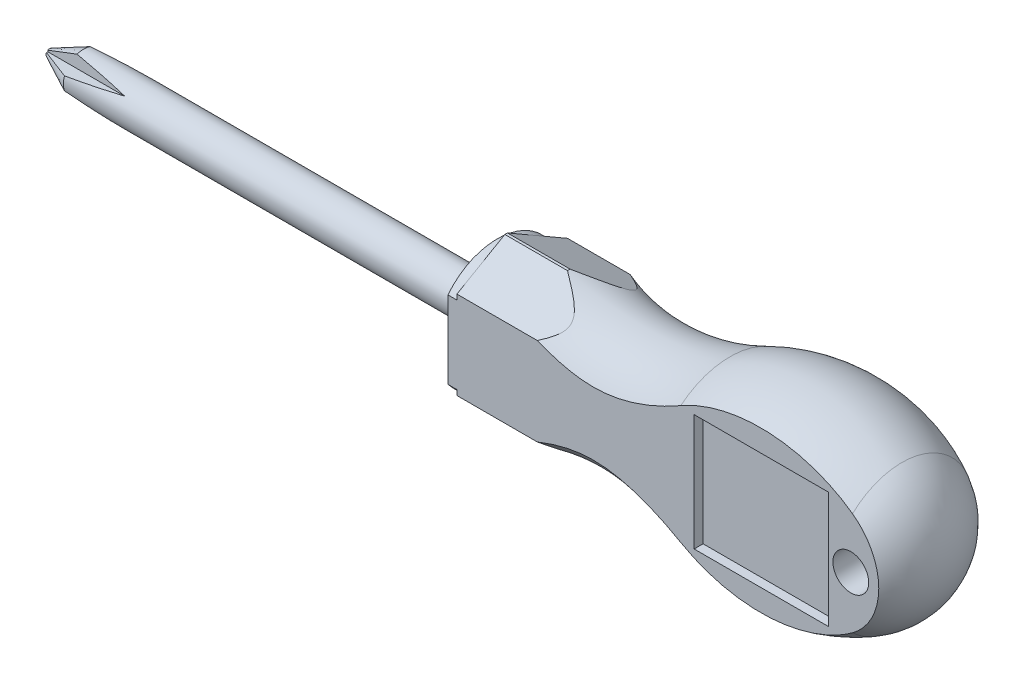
ISO-10303-21;
HEADER;
FILE_DESCRIPTION(('STEP AP214'),'2;1');
FILE_NAME('part.step','',(''),(''),'','','');
FILE_SCHEMA(('AUTOMOTIVE_DESIGN { 1 0 10303 214 1 1 1 1 }'));
ENDSEC;
DATA;
#1=APPLICATION_CONTEXT('core data for automotive mechanical design processes');
#2=APPLICATION_PROTOCOL_DEFINITION('international standard','automotive_design',2000,#1);
#3=PRODUCT_CONTEXT('',#1,'mechanical');
#4=PRODUCT('Part','Part','',(#3));
#5=PRODUCT_RELATED_PRODUCT_CATEGORY('part','',(#4));
#6=PRODUCT_DEFINITION_FORMATION('','',#4);
#7=PRODUCT_DEFINITION_CONTEXT('part definition',#1,'design');
#8=PRODUCT_DEFINITION('design','',#6,#7);
#9=PRODUCT_DEFINITION_SHAPE('','',#8);
#10=(LENGTH_UNIT() NAMED_UNIT(*) SI_UNIT(.MILLI.,.METRE.));
#11=(NAMED_UNIT(*) PLANE_ANGLE_UNIT() SI_UNIT($,.RADIAN.));
#12=(NAMED_UNIT(*) SI_UNIT($,.STERADIAN.) SOLID_ANGLE_UNIT());
#13=UNCERTAINTY_MEASURE_WITH_UNIT(LENGTH_MEASURE(1.E-05),#10,'distance_accuracy_value','');
#14=(GEOMETRIC_REPRESENTATION_CONTEXT(3) GLOBAL_UNCERTAINTY_ASSIGNED_CONTEXT((#13)) GLOBAL_UNIT_ASSIGNED_CONTEXT((#10,
#11,#12)) REPRESENTATION_CONTEXT('',''));
#15=CARTESIAN_POINT('',(0.,0.,0.));
#16=DIRECTION('',(0.,0.,1.));
#17=DIRECTION('',(1.,0.,0.));
#18=AXIS2_PLACEMENT_3D('',#15,#16,#17);
#19=CARTESIAN_POINT('',(-96.2069378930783,0.,0.));
#20=DIRECTION('',(1.,0.,0.));
#21=DIRECTION('',(0.,1.,0.));
#22=AXIS2_PLACEMENT_3D('',#19,#20,#21);
#23=CONICAL_SURFACE('',#22,2.25,0.45378560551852);
#24=CARTESIAN_POINT('',(-96.2067128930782,-2.12920881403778,-0.727642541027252));
#25=CARTESIAN_POINT('',(-96.441013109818,-2.01957770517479,-0.695051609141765));
#26=CARTESIAN_POINT('',(-96.6753104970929,-1.90994040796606,-0.662461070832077));
#27=CARTESIAN_POINT('',(-97.1438858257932,-1.69062363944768,-0.597282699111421));
#28=CARTESIAN_POINT('',(-97.3781637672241,-1.58094416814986,-0.564694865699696));
#29=CARTESIAN_POINT('',(-97.8466846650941,-1.36151407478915,-0.499524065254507));
#30=CARTESIAN_POINT('',(-98.0809276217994,-1.25176345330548,-0.466941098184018));
#31=CARTESIAN_POINT('',(-98.5493486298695,-1.03212059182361,-0.40178419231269));
#32=CARTESIAN_POINT('',(-98.7835266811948,-0.922228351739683,-0.369210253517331));
#33=CARTESIAN_POINT('',(-99.0996976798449,-0.773525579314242,-0.325231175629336));
#34=CARTESIAN_POINT('',(-99.181772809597,-0.734893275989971,-0.313814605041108));
#35=CARTESIAN_POINT('',(-99.3458825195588,-0.657541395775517,-0.29098710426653));
#36=CARTESIAN_POINT('',(-99.4279170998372,-0.618821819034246,-0.279576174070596));
#37=CARTESIAN_POINT('',(-99.5919250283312,-0.541249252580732,-0.256762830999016));
#38=CARTESIAN_POINT('',(-99.6738983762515,-0.502396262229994,-0.245360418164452));
#39=CARTESIAN_POINT('',(-99.8377004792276,-0.424379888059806,-0.222575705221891));
#40=CARTESIAN_POINT('',(-99.9195292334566,-0.385216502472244,-0.211193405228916));
#41=CARTESIAN_POINT('',(-100.00124373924,-0.345809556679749,-0.199826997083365));
#42=B_SPLINE_CURVE_WITH_KNOTS('',3,(#24,#25,#26,#27,#28,#29,#30,#31,#32,#33,#34,#35,#36,#37,#38,
#39,#40,#41),.UNSPECIFIED.,.F.,.F.,(4,2,2,2,2,2,2,2,4),(0.,0.78217625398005,1.56435228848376,
2.34652203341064,3.12869225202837,3.40297686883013,3.67726101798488,3.95154648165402,
4.2258335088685),.UNSPECIFIED.);
#43=CARTESIAN_POINT('',(-96.2069378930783,-2.12910353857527,-0.727611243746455));
#44=VERTEX_POINT('',#43);
#45=CARTESIAN_POINT('',(-99.9999999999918,-0.346410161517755,-0.200000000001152));
#46=VERTEX_POINT('',#45);
#47=EDGE_CURVE('E907',#44,#46,#42,.T.);
#48=ORIENTED_EDGE('',*,*,#47,.F.);
#49=CARTESIAN_POINT('',(-96.2069378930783,0.,0.));
#50=DIRECTION('',(1.,0.,0.));
#51=DIRECTION('',(0.,1.,0.));
#52=AXIS2_PLACEMENT_3D('',#49,#50,#51);
#53=CIRCLE('',#52,2.25);
#54=CARTESIAN_POINT('',(-96.2069378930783,-2.12910353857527,0.727611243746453));
#55=VERTEX_POINT('',#54);
#56=EDGE_CURVE('E748',#55,#44,#53,.T.);
#57=ORIENTED_EDGE('',*,*,#56,.F.);
#58=CARTESIAN_POINT('',(-100.001243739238,-0.345809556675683,0.199826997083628));
#59=CARTESIAN_POINT('',(-99.9185195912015,-0.38570297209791,0.211333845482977));
#60=CARTESIAN_POINT('',(-99.8356785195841,-0.425347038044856,0.222856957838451));
#61=CARTESIAN_POINT('',(-99.6698493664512,-0.504319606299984,0.245923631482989));
#62=CARTESIAN_POINT('',(-99.586861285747,-0.543648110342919,0.257467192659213));
#63=CARTESIAN_POINT('',(-99.3378073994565,-0.661434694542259,0.292110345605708));
#64=CARTESIAN_POINT('',(-99.1716499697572,-0.739694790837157,0.31522268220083));
#65=CARTESIAN_POINT('',(-98.8392420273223,-0.896013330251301,0.361460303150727));
#66=CARTESIAN_POINT('',(-98.67299151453,-0.974071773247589,0.384585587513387));
#67=CARTESIAN_POINT('',(-98.1741724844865,-1.20810730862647,0.453970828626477));
#68=CARTESIAN_POINT('',(-97.8415390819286,-1.36394338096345,0.500239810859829));
#69=CARTESIAN_POINT('',(-97.2918685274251,-1.62134240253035,0.576698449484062));
#70=CARTESIAN_POINT('',(-97.0748467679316,-1.72293888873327,0.606885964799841));
#71=CARTESIAN_POINT('',(-96.6407891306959,-1.92609643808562,0.667262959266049));
#72=CARTESIAN_POINT('',(-96.4237532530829,-2.02765750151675,0.697452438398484));
#73=CARTESIAN_POINT('',(-96.2067128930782,-2.12920881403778,0.727642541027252));
#74=B_SPLINE_CURVE_WITH_KNOTS('',3,(#58,#59,#60,#61,#62,#63,#64,#65,#66,#67,#68,#69,#70,#71,#72,
#73),.UNSPECIFIED.,.F.,.F.,(4,2,2,2,2,2,2,4),(0.,0.277675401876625,0.555349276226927,
1.11069039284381,1.66603184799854,2.77672346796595,3.50128139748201,4.22583342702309),.UNSPECIFIED.);
#75=CARTESIAN_POINT('',(-100.,-0.346410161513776,0.200000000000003));
#76=VERTEX_POINT('',#75);
#77=EDGE_CURVE('E920',#76,#55,#74,.T.);
#78=ORIENTED_EDGE('',*,*,#77,.F.);
#79=CARTESIAN_POINT('',(-100.,0.,0.));
#80=DIRECTION('',(1.,0.,0.));
#81=DIRECTION('',(0.,1.,0.));
#82=AXIS2_PLACEMENT_3D('',#79,#80,#81);
#83=CIRCLE('',#82,0.400000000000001);
#84=EDGE_CURVE('E673',#76,#46,#83,.T.);
#85=ORIENTED_EDGE('',*,*,#84,.T.);
#86=EDGE_LOOP('',(#48,#57,#78,#85));
#87=FACE_BOUND('',#86,.T.);
#88=ADVANCED_FACE('F70',(#87),#23,.T.);
#89=CARTESIAN_POINT('',(-96.2067128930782,-0.727642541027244,2.12920881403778));
#90=CARTESIAN_POINT('',(-96.441013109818,-0.695051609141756,2.01957770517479));
#91=CARTESIAN_POINT('',(-96.6753104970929,-0.662461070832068,1.90994040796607));
#92=CARTESIAN_POINT('',(-97.1438858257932,-0.597282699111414,1.69062363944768));
#93=CARTESIAN_POINT('',(-97.3781637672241,-0.564694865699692,1.58094416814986));
#94=CARTESIAN_POINT('',(-97.8466846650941,-0.499524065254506,1.36151407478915));
#95=CARTESIAN_POINT('',(-98.0809276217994,-0.466941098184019,1.25176345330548));
#96=CARTESIAN_POINT('',(-98.5493486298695,-0.401784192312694,1.0321205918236));
#97=CARTESIAN_POINT('',(-98.7835266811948,-0.369210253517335,0.922228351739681));
#98=CARTESIAN_POINT('',(-99.0996976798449,-0.325231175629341,0.77352557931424));
#99=CARTESIAN_POINT('',(-99.181772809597,-0.313814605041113,0.734893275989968));
#100=CARTESIAN_POINT('',(-99.3458825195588,-0.290987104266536,0.657541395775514));
#101=CARTESIAN_POINT('',(-99.4279170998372,-0.279576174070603,0.618821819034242));
#102=CARTESIAN_POINT('',(-99.5919250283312,-0.256762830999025,0.541249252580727));
#103=CARTESIAN_POINT('',(-99.6738983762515,-0.245360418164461,0.502396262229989));
#104=CARTESIAN_POINT('',(-99.8377004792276,-0.2225757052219,0.424379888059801));
#105=CARTESIAN_POINT('',(-99.9195292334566,-0.211193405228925,0.385216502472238));
#106=CARTESIAN_POINT('',(-100.00124373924,-0.199826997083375,0.345809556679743));
#107=B_SPLINE_CURVE_WITH_KNOTS('',3,(#89,#90,#91,#92,#93,#94,#95,#96,#97,#98,#99,#100,#101,#102,
#103,#104,#105,#106),.UNSPECIFIED.,.F.,.F.,(4,2,2,2,2,2,2,2,4),(0.,0.78217625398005,
1.56435228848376,2.34652203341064,3.12869225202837,3.40297686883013,3.67726101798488,
3.95154648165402,4.2258335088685),.UNSPECIFIED.);
#108=CARTESIAN_POINT('',(-96.2069378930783,-0.727611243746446,2.12910353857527));
#109=VERTEX_POINT('',#108);
#110=CARTESIAN_POINT('',(-99.9999999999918,-0.200000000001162,0.346410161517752));
#111=VERTEX_POINT('',#110);
#112=EDGE_CURVE('E377',#109,#111,#107,.T.);
#113=ORIENTED_EDGE('',*,*,#112,.F.);
#114=CARTESIAN_POINT('',(-96.2069378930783,0.727611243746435,2.12910353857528));
#115=VERTEX_POINT('',#114);
#116=EDGE_CURVE('E612',#115,#109,#53,.T.);
#117=ORIENTED_EDGE('',*,*,#116,.F.);
#118=CARTESIAN_POINT('',(-100.001243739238,0.199826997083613,0.34580955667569));
#119=CARTESIAN_POINT('',(-99.9185195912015,0.211333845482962,0.385702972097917));
#120=CARTESIAN_POINT('',(-99.8356785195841,0.222856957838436,0.425347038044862));
#121=CARTESIAN_POINT('',(-99.6698493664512,0.245923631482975,0.504319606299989));
#122=CARTESIAN_POINT('',(-99.586861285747,0.2574671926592,0.543648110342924));
#123=CARTESIAN_POINT('',(-99.3378073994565,0.292110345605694,0.661434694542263));
#124=CARTESIAN_POINT('',(-99.1716499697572,0.315222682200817,0.739694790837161));
#125=CARTESIAN_POINT('',(-98.8392420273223,0.361460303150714,0.896013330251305));
#126=CARTESIAN_POINT('',(-98.67299151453,0.384585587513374,0.974071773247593));
#127=CARTESIAN_POINT('',(-98.1741724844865,0.453970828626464,1.20810730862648));
#128=CARTESIAN_POINT('',(-97.8415390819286,0.500239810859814,1.36394338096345));
#129=CARTESIAN_POINT('',(-97.2918685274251,0.576698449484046,1.62134240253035));
#130=CARTESIAN_POINT('',(-97.0748467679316,0.606885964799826,1.72293888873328));
#131=CARTESIAN_POINT('',(-96.6407891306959,0.667262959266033,1.92609643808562));
#132=CARTESIAN_POINT('',(-96.4237532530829,0.697452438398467,2.02765750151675));
#133=CARTESIAN_POINT('',(-96.2067128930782,0.727642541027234,2.12920881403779));
#134=B_SPLINE_CURVE_WITH_KNOTS('',3,(#118,#119,#120,#121,#122,#123,#124,#125,#126,#127,#128,
#129,#130,#131,#132,#133),.UNSPECIFIED.,.F.,.F.,(4,2,2,2,2,2,2,4),(0.,0.277675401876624,
0.555349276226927,1.1106903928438,1.66603184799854,2.77672346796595,3.50128139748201,
4.22583342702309),.UNSPECIFIED.);
#135=CARTESIAN_POINT('',(-100.,0.19999999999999,0.346410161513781));
#136=VERTEX_POINT('',#135);
#137=EDGE_CURVE('E395',#136,#115,#134,.T.);
#138=ORIENTED_EDGE('',*,*,#137,.F.);
#139=EDGE_CURVE('E669',#136,#111,#83,.T.);
#140=ORIENTED_EDGE('',*,*,#139,.T.);
#141=EDGE_LOOP('',(#113,#117,#138,#140));
#142=FACE_BOUND('',#141,.T.);
#143=ADVANCED_FACE('F760',(#142),#23,.T.);
#144=CARTESIAN_POINT('',(-96.2067128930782,2.12920881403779,0.727642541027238));
#145=CARTESIAN_POINT('',(-96.441013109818,2.01957770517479,0.695051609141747));
#146=CARTESIAN_POINT('',(-96.6753104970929,1.90994040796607,0.662461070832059));
#147=CARTESIAN_POINT('',(-97.1438858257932,1.69062363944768,0.597282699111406));
#148=CARTESIAN_POINT('',(-97.3781637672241,1.58094416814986,0.564694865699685));
#149=CARTESIAN_POINT('',(-97.8466846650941,1.36151407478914,0.499524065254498));
#150=CARTESIAN_POINT('',(-98.0809276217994,1.25176345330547,0.466941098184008));
#151=CARTESIAN_POINT('',(-98.5493486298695,1.0321205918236,0.401784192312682));
#152=CARTESIAN_POINT('',(-98.7835266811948,0.922228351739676,0.369210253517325));
#153=CARTESIAN_POINT('',(-99.0996976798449,0.773525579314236,0.325231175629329));
#154=CARTESIAN_POINT('',(-99.181772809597,0.734893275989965,0.313814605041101));
#155=CARTESIAN_POINT('',(-99.3458825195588,0.65754139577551,0.290987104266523));
#156=CARTESIAN_POINT('',(-99.4279170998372,0.618821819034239,0.27957617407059));
#157=CARTESIAN_POINT('',(-99.5919250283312,0.541249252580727,0.256762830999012));
#158=CARTESIAN_POINT('',(-99.6738983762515,0.502396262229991,0.245360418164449));
#159=CARTESIAN_POINT('',(-99.8377004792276,0.424379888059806,0.222575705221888));
#160=CARTESIAN_POINT('',(-99.9195292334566,0.385216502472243,0.211193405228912));
#161=CARTESIAN_POINT('',(-100.00124373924,0.345809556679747,0.199826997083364));
#162=B_SPLINE_CURVE_WITH_KNOTS('',3,(#144,#145,#146,#147,#148,#149,#150,#151,#152,#153,#154,
#155,#156,#157,#158,#159,#160,#161),.UNSPECIFIED.,.F.,.F.,(4,2,2,2,2,2,2,2,4),(0.,
0.782176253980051,1.56435228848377,2.34652203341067,3.12869225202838,3.40297686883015,
3.67726101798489,3.95154648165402,4.2258335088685),.UNSPECIFIED.);
#163=CARTESIAN_POINT('',(-96.2069378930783,2.12910353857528,0.727611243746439));
#164=VERTEX_POINT('',#163);
#165=CARTESIAN_POINT('',(-99.9999999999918,0.346410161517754,0.200000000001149));
#166=VERTEX_POINT('',#165);
#167=EDGE_CURVE('E722',#164,#166,#162,.T.);
#168=ORIENTED_EDGE('',*,*,#167,.F.);
#169=CARTESIAN_POINT('',(-96.2069378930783,2.12910353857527,-0.727611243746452));
#170=VERTEX_POINT('',#169);
#171=EDGE_CURVE('E607',#170,#164,#53,.T.);
#172=ORIENTED_EDGE('',*,*,#171,.F.);
#173=CARTESIAN_POINT('',(-100.0002,0.346313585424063,-0.199972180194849));
#174=CARTESIAN_POINT('',(-99.9173690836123,0.386255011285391,-0.211493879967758));
#175=CARTESIAN_POINT('',(-99.834421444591,0.42594750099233,-0.223031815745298));
#176=CARTESIAN_POINT('',(-99.6683794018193,0.505017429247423,-0.246128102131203));
#177=CARTESIAN_POINT('',(-99.5852849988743,0.544394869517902,-0.257686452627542));
#178=CARTESIAN_POINT('',(-99.335912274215,0.66232856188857,-0.292373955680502));
#179=CARTESIAN_POINT('',(-99.1695424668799,0.74068712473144,-0.315515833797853));
#180=CARTESIAN_POINT('',(-98.8367099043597,0.897202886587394,-0.361812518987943));
#181=CARTESIAN_POINT('',(-98.6702471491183,0.975360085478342,-0.384967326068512));
#182=CARTESIAN_POINT('',(-98.1707914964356,1.20969207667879,-0.454441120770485));
#183=CARTESIAN_POINT('',(-97.8377338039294,1.36572604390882,-0.500769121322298));
#184=CARTESIAN_POINT('',(-97.2883479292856,1.62299061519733,-0.577188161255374));
#185=CARTESIAN_POINT('',(-97.0720352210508,1.72425493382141,-0.607277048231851));
#186=CARTESIAN_POINT('',(-96.6393957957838,1.92674844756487,-0.667456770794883));
#187=CARTESIAN_POINT('',(-96.4230690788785,2.02797764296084,-0.697547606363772));
#188=CARTESIAN_POINT('',(-96.2067378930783,2.12919711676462,-0.727639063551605));
#189=B_SPLINE_CURVE_WITH_KNOTS('',3,(#173,#174,#175,#176,#177,#178,#179,#180,#181,#182,#183,
#184,#185,#186,#187,#188),.UNSPECIFIED.,.F.,.F.,(4,2,2,2,2,2,2,4),(0.,0.278029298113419,
0.556057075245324,1.11210603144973,1.66815532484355,2.78026257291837,3.50245294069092,
4.22463748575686),.UNSPECIFIED.);
#190=CARTESIAN_POINT('',(-100.,0.346410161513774,-0.200000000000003));
#191=VERTEX_POINT('',#190);
#192=EDGE_CURVE('E720',#191,#170,#189,.T.);
#193=ORIENTED_EDGE('',*,*,#192,.F.);
#194=EDGE_CURVE('E662',#191,#166,#83,.T.);
#195=ORIENTED_EDGE('',*,*,#194,.T.);
#196=EDGE_LOOP('',(#168,#172,#193,#195));
#197=FACE_BOUND('',#196,.T.);
#198=ADVANCED_FACE('F900',(#197),#23,.T.);
#199=CARTESIAN_POINT('',(-100.,0.,0.));
#200=DIRECTION('',(1.,0.,0.));
#201=DIRECTION('',(0.,1.,0.));
#202=AXIS2_PLACEMENT_3D('',#199,#200,#201);
#203=CYLINDRICAL_SURFACE('',#202,8.);
#204=DIRECTION('',(-1.,0.,0.));
#205=VECTOR('',#204,1.);
#206=CARTESIAN_POINT('',(-35.,-7.99866949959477,-0.145898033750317));
#207=LINE('',#206,#205);
#208=CARTESIAN_POINT('',(-42.,-7.99866949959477,-0.145898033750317));
#209=VERTEX_POINT('',#208);
#210=CARTESIAN_POINT('',(-49.,-7.99866949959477,-0.145898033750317));
#211=VERTEX_POINT('',#210);
#212=EDGE_CURVE('E469',#209,#211,#207,.T.);
#213=ORIENTED_EDGE('',*,*,#212,.F.);
#214=CARTESIAN_POINT('',(-42.,0.,0.));
#215=DIRECTION('',(1.,0.,0.));
#216=DIRECTION('',(0.,1.,0.));
#217=AXIS2_PLACEMENT_3D('',#214,#215,#216);
#218=CIRCLE('',#217,8.);
#219=CARTESIAN_POINT('',(-42.,-7.99866949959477,0.145898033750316));
#220=VERTEX_POINT('',#219);
#221=EDGE_CURVE('E638',#220,#209,#218,.T.);
#222=ORIENTED_EDGE('',*,*,#221,.F.);
#223=DIRECTION('',(-1.,0.,0.));
#224=VECTOR('',#223,1.);
#225=CARTESIAN_POINT('',(-35.,-7.99866949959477,0.145898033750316));
#226=LINE('',#225,#224);
#227=CARTESIAN_POINT('',(-49.,-7.99866949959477,0.145898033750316));
#228=VERTEX_POINT('',#227);
#229=EDGE_CURVE('E442',#220,#228,#226,.T.);
#230=ORIENTED_EDGE('',*,*,#229,.T.);
#231=CARTESIAN_POINT('',(-49.,0.,0.));
#232=DIRECTION('',(1.,0.,0.));
#233=DIRECTION('',(0.,1.,0.));
#234=AXIS2_PLACEMENT_3D('',#231,#232,#233);
#235=CIRCLE('',#234,7.99999999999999);
#236=EDGE_CURVE('E632',#228,#211,#235,.T.);
#237=ORIENTED_EDGE('',*,*,#236,.T.);
#238=EDGE_LOOP('',(#213,#222,#230,#237));
#239=FACE_BOUND('',#238,.T.);
#240=ADVANCED_FACE('F876',(#239),#203,.T.);
#241=DIRECTION('',(-1.,0.,0.));
#242=VECTOR('',#241,1.);
#243=CARTESIAN_POINT('',(-35.,-4.12568615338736,-6.85410196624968));
#244=LINE('',#243,#242);
#245=CARTESIAN_POINT('',(-42.,-4.12568615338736,-6.85410196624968));
#246=VERTEX_POINT('',#245);
#247=CARTESIAN_POINT('',(-49.,-4.12568615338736,-6.85410196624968));
#248=VERTEX_POINT('',#247);
#249=EDGE_CURVE('E470',#246,#248,#244,.T.);
#250=ORIENTED_EDGE('',*,*,#249,.T.);
#251=CARTESIAN_POINT('',(-49.,-3.87298334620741,-7.));
#252=VERTEX_POINT('',#251);
#253=EDGE_CURVE('E789',#248,#252,#235,.T.);
#254=ORIENTED_EDGE('',*,*,#253,.T.);
#255=DIRECTION('',(-1.,0.,0.));
#256=VECTOR('',#255,1.);
#257=CARTESIAN_POINT('',(-35.,-3.87298334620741,-7.));
#258=LINE('',#257,#256);
#259=CARTESIAN_POINT('',(-42.,-3.87298334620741,-7.));
#260=VERTEX_POINT('',#259);
#261=EDGE_CURVE('E458',#260,#252,#258,.T.);
#262=ORIENTED_EDGE('',*,*,#261,.F.);
#263=EDGE_CURVE('E796',#246,#260,#218,.T.);
#264=ORIENTED_EDGE('',*,*,#263,.F.);
#265=EDGE_LOOP('',(#250,#254,#262,#264));
#266=FACE_BOUND('',#265,.T.);
#267=ADVANCED_FACE('F838',(#266),#203,.T.);
#268=DIRECTION('',(-1.,0.,0.));
#269=VECTOR('',#268,1.);
#270=CARTESIAN_POINT('',(-35.,3.87298334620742,-7.));
#271=LINE('',#270,#269);
#272=CARTESIAN_POINT('',(-42.,3.87298334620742,-7.));
#273=VERTEX_POINT('',#272);
#274=CARTESIAN_POINT('',(-49.,3.87298334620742,-7.));
#275=VERTEX_POINT('',#274);
#276=EDGE_CURVE('E460',#273,#275,#271,.T.);
#277=ORIENTED_EDGE('',*,*,#276,.T.);
#278=CARTESIAN_POINT('',(-49.,4.12568615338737,-6.85410196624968));
#279=VERTEX_POINT('',#278);
#280=EDGE_CURVE('E631',#275,#279,#235,.T.);
#281=ORIENTED_EDGE('',*,*,#280,.T.);
#282=DIRECTION('',(-1.,0.,0.));
#283=VECTOR('',#282,1.);
#284=CARTESIAN_POINT('',(-35.,4.12568615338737,-6.85410196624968));
#285=LINE('',#284,#283);
#286=CARTESIAN_POINT('',(-42.,4.12568615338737,-6.85410196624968));
#287=VERTEX_POINT('',#286);
#288=EDGE_CURVE('E479',#287,#279,#285,.T.);
#289=ORIENTED_EDGE('',*,*,#288,.F.);
#290=EDGE_CURVE('E637',#273,#287,#218,.T.);
#291=ORIENTED_EDGE('',*,*,#290,.F.);
#292=EDGE_LOOP('',(#277,#281,#289,#291));
#293=FACE_BOUND('',#292,.T.);
#294=ADVANCED_FACE('F871',(#293),#203,.T.);
#295=CARTESIAN_POINT('',(-49.,8.,0.));
#296=DIRECTION('',(-1.,0.,0.));
#297=DIRECTION('',(0.,-1.,0.));
#298=AXIS2_PLACEMENT_3D('',#295,#296,#297);
#299=PLANE('',#298);
#300=DIRECTION('',(0.,0.5,-0.866025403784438));
#301=VECTOR('',#300,1.);
#302=CARTESIAN_POINT('',(-49.,-4.12568615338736,-6.85410196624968));
#303=LINE('',#302,#301);
#304=CARTESIAN_POINT('',(-49.,-6.06217782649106,-3.5));
#305=VERTEX_POINT('',#304);
#306=EDGE_CURVE('E466',#211,#305,#303,.T.);
#307=ORIENTED_EDGE('',*,*,#306,.F.);
#308=ORIENTED_EDGE('',*,*,#236,.F.);
#309=DIRECTION('',(0.,-0.5,-0.866025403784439));
#310=VECTOR('',#309,1.);
#311=CARTESIAN_POINT('',(-49.,-7.99866949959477,0.145898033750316));
#312=LINE('',#311,#310);
#313=CARTESIAN_POINT('',(-49.,-6.06217782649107,3.5));
#314=VERTEX_POINT('',#313);
#315=EDGE_CURVE('E443',#314,#228,#312,.T.);
#316=ORIENTED_EDGE('',*,*,#315,.F.);
#317=CARTESIAN_POINT('',(-49.,0.,0.));
#318=DIRECTION('',(1.,0.,0.));
#319=DIRECTION('',(0.,1.,0.));
#320=AXIS2_PLACEMENT_3D('',#317,#318,#319);
#321=CIRCLE('',#320,7.);
#322=EDGE_CURVE('E627',#314,#305,#321,.T.);
#323=ORIENTED_EDGE('',*,*,#322,.T.);
#324=EDGE_LOOP('',(#307,#308,#316,#323));
#325=FACE_BOUND('',#324,.T.);
#326=ADVANCED_FACE('F880',(#325),#299,.T.);
#327=EDGE_CURVE('E438',#305,#248,#303,.T.);
#328=ORIENTED_EDGE('',*,*,#327,.F.);
#329=CARTESIAN_POINT('',(-49.,0.,-7.));
#330=VERTEX_POINT('',#329);
#331=EDGE_CURVE('E782',#305,#330,#321,.T.);
#332=ORIENTED_EDGE('',*,*,#331,.T.);
#333=DIRECTION('',(0.,1.,0.));
#334=VECTOR('',#333,1.);
#335=CARTESIAN_POINT('',(-49.,3.87298334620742,-7.));
#336=LINE('',#335,#334);
#337=EDGE_CURVE('E455',#252,#330,#336,.T.);
#338=ORIENTED_EDGE('',*,*,#337,.F.);
#339=ORIENTED_EDGE('',*,*,#253,.F.);
#340=EDGE_LOOP('',(#328,#332,#338,#339));
#341=FACE_BOUND('',#340,.T.);
#342=ADVANCED_FACE('F841',(#341),#299,.T.);
#343=DIRECTION('',(0.,-0.5,0.866025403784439));
#344=VECTOR('',#343,1.);
#345=CARTESIAN_POINT('',(-49.,4.90747728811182,5.50000000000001));
#346=LINE('',#345,#344);
#347=CARTESIAN_POINT('',(-49.,7.99866949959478,0.14589803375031));
#348=VERTEX_POINT('',#347);
#349=CARTESIAN_POINT('',(-49.,6.06217782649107,3.5));
#350=VERTEX_POINT('',#349);
#351=EDGE_CURVE('E448',#348,#350,#346,.T.);
#352=ORIENTED_EDGE('',*,*,#351,.F.);
#353=CARTESIAN_POINT('',(-49.,7.99866949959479,-0.14589803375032));
#354=VERTEX_POINT('',#353);
#355=EDGE_CURVE('E626',#354,#348,#235,.T.);
#356=ORIENTED_EDGE('',*,*,#355,.F.);
#357=DIRECTION('',(0.,0.500000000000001,0.866025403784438));
#358=VECTOR('',#357,1.);
#359=CARTESIAN_POINT('',(-49.,7.99866949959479,-0.14589803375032));
#360=LINE('',#359,#358);
#361=CARTESIAN_POINT('',(-49.,6.06217782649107,-3.5));
#362=VERTEX_POINT('',#361);
#363=EDGE_CURVE('E447',#362,#354,#360,.T.);
#364=ORIENTED_EDGE('',*,*,#363,.F.);
#365=EDGE_CURVE('E776',#362,#350,#321,.T.);
#366=ORIENTED_EDGE('',*,*,#365,.T.);
#367=EDGE_LOOP('',(#352,#356,#364,#366));
#368=FACE_BOUND('',#367,.T.);
#369=ADVANCED_FACE('F857',(#368),#299,.T.);
#370=CARTESIAN_POINT('',(-49.,-4.90747728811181,5.50000000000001));
#371=VERTEX_POINT('',#370);
#372=EDGE_CURVE('E439',#371,#314,#312,.T.);
#373=ORIENTED_EDGE('',*,*,#372,.F.);
#374=DIRECTION('',(0.,-1.,0.));
#375=VECTOR('',#374,1.);
#376=CARTESIAN_POINT('',(-49.,8.,5.50000000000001));
#377=LINE('',#376,#375);
#378=CARTESIAN_POINT('',(-49.,-4.33012701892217,5.50000000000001));
#379=VERTEX_POINT('',#378);
#380=EDGE_CURVE('E817',#379,#371,#377,.T.);
#381=ORIENTED_EDGE('',*,*,#380,.F.);
#382=EDGE_CURVE('E622',#379,#314,#321,.T.);
#383=ORIENTED_EDGE('',*,*,#382,.T.);
#384=EDGE_LOOP('',(#373,#381,#383));
#385=FACE_BOUND('',#384,.T.);
#386=ADVANCED_FACE('F886',(#385),#299,.T.);
#387=EDGE_CURVE('E459',#330,#275,#336,.T.);
#388=ORIENTED_EDGE('',*,*,#387,.F.);
#389=EDGE_CURVE('E779',#330,#362,#321,.T.);
#390=ORIENTED_EDGE('',*,*,#389,.T.);
#391=EDGE_CURVE('E476',#279,#362,#360,.T.);
#392=ORIENTED_EDGE('',*,*,#391,.F.);
#393=ORIENTED_EDGE('',*,*,#280,.F.);
#394=EDGE_LOOP('',(#388,#390,#392,#393));
#395=FACE_BOUND('',#394,.T.);
#396=ADVANCED_FACE('F846',(#395),#299,.T.);
#397=CARTESIAN_POINT('',(-9.,0.,0.));
#398=DIRECTION('',(1.,0.,0.));
#399=DIRECTION('',(0.,-1.,0.));
#400=AXIS2_PLACEMENT_3D('',#397,#398,#399);
#401=SPHERICAL_SURFACE('',#400,9.);
#402=CARTESIAN_POINT('',(-4.80330765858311,1.9903045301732,-7.70885602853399));
#403=CARTESIAN_POINT('',(-4.67987699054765,1.97812861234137,-7.64484422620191));
#404=CARTESIAN_POINT('',(-4.5576421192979,1.9544311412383,-7.58058776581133));
#405=CARTESIAN_POINT('',(-4.31850956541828,1.88444434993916,-7.4533214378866));
#406=CARTESIAN_POINT('',(-4.20163401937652,1.83806920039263,-7.39031726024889));
#407=CARTESIAN_POINT('',(-3.97697916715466,1.72318761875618,-7.26771163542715));
#408=CARTESIAN_POINT('',(-3.8692147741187,1.65464575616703,-7.20811581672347));
#409=CARTESIAN_POINT('',(-3.66690742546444,1.49643441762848,-7.09495921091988));
#410=CARTESIAN_POINT('',(-3.57234823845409,1.40679124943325,-7.04139103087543));
#411=CARTESIAN_POINT('',(-3.40676376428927,1.21510191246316,-6.94666826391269));
#412=CARTESIAN_POINT('',(-3.33453799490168,1.11440391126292,-6.90489938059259));
#413=CARTESIAN_POINT('',(-3.20885866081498,0.898527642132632,-6.83170669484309));
#414=CARTESIAN_POINT('',(-3.15538353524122,0.783366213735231,-6.80027101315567));
#415=CARTESIAN_POINT('',(-3.07673416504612,0.559534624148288,-6.75383883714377));
#416=CARTESIAN_POINT('',(-3.04862965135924,0.452244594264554,-6.73714768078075));
#417=CARTESIAN_POINT('',(-3.01057498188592,0.233417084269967,-6.71451668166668));
#418=CARTESIAN_POINT('',(-3.0006079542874,0.121883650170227,-6.70856684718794));
#419=CARTESIAN_POINT('',(-2.99951148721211,-0.0885410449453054,-6.70791228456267));
#420=CARTESIAN_POINT('',(-3.00636627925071,-0.187425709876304,-6.71200424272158));
#421=CARTESIAN_POINT('',(-3.03442671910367,-0.382381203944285,-6.72870585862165));
#422=CARTESIAN_POINT('',(-3.05563115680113,-0.478452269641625,-6.7413147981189));
#423=CARTESIAN_POINT('',(-3.11107629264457,-0.66429396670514,-6.77413263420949));
#424=CARTESIAN_POINT('',(-3.14518792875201,-0.754116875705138,-6.79426626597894));
#425=CARTESIAN_POINT('',(-3.22503287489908,-0.926568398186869,-6.84111172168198));
#426=CARTESIAN_POINT('',(-3.27076935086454,-1.00919504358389,-6.86782533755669));
#427=CARTESIAN_POINT('',(-3.37666625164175,-1.17263374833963,-6.92923867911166));
#428=CARTESIAN_POINT('',(-3.43773100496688,-1.25267340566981,-6.96442874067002));
#429=CARTESIAN_POINT('',(-3.56969281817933,-1.40147200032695,-7.03981280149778));
#430=CARTESIAN_POINT('',(-3.64059436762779,-1.4702257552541,-7.08000908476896));
#431=CARTESIAN_POINT('',(-3.80012285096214,-1.60389738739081,-7.16960509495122));
#432=CARTESIAN_POINT('',(-3.88985563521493,-1.66714830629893,-7.21952158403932));
#433=CARTESIAN_POINT('',(-4.07706172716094,-1.77764123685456,-7.32250983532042));
#434=CARTESIAN_POINT('',(-4.1745390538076,-1.82487486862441,-7.37558323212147));
#435=CARTESIAN_POINT('',(-4.35986983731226,-1.89699324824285,-7.4753631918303));
#436=CARTESIAN_POINT('',(-4.44697267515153,-1.92416797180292,-7.52183016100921));
#437=CARTESIAN_POINT('',(-4.62360194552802,-1.96635493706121,-7.61518387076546));
#438=CARTESIAN_POINT('',(-4.71312258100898,-1.98139399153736,-7.66206945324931));
#439=CARTESIAN_POINT('',(-4.80330765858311,-1.9903045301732,-7.70885602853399));
#440=B_SPLINE_CURVE_WITH_KNOTS('',3,(#402,#403,#404,#405,#406,#407,#408,#409,#410,#411,#412,
#413,#414,#415,#416,#417,#418,#419,#420,#421,#422,#423,#424,#425,#426,#427,#428,#429,#430,#431,
#432,#433,#434,#435,#436,#437,#438,#439),.UNSPECIFIED.,.F.,.F.,(4,2,2,2,2,2,2,2,2,2,2,2,2,2,2,2,
2,2,4),(0.,0.418354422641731,0.838304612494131,1.25892938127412,1.67903249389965,
2.06904704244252,2.45861164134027,2.79315963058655,3.1273962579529,3.42357399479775,
3.71972675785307,4.01299329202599,4.30633978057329,4.62500983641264,4.94382581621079,
5.30418111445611,5.66472465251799,5.97116902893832,6.2769344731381),.UNSPECIFIED.);
#441=CARTESIAN_POINT('',(-4.8031076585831,1.99028475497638,-7.70875225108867));
#442=VERTEX_POINT('',#441);
#443=CARTESIAN_POINT('',(-4.80310765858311,-1.99028475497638,-7.70875225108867));
#444=VERTEX_POINT('',#443);
#445=EDGE_CURVE('E554',#442,#444,#440,.T.);
#446=ORIENTED_EDGE('',*,*,#445,.F.);
#447=CARTESIAN_POINT('',(-4.80310765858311,0.,0.));
#448=DIRECTION('',(1.,0.,0.));
#449=DIRECTION('',(0.,1.,0.));
#450=AXIS2_PLACEMENT_3D('',#447,#448,#449);
#451=CIRCLE('',#450,7.96153846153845);
#452=CARTESIAN_POINT('',(-4.80310765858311,5.75639597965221,5.50000000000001));
#453=VERTEX_POINT('',#452);
#454=EDGE_CURVE('E643',#442,#453,#451,.T.);
#455=ORIENTED_EDGE('',*,*,#454,.T.);
#456=CARTESIAN_POINT('',(-9.,0.,5.50000000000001));
#457=DIRECTION('',(0.,0.,-1.));
#458=DIRECTION('',(-1.,0.,0.));
#459=AXIS2_PLACEMENT_3D('',#456,#457,#458);
#460=CIRCLE('',#459,7.1239034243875);
#461=CARTESIAN_POINT('',(-4.8031076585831,-5.75639597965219,5.50000000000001));
#462=VERTEX_POINT('',#461);
#463=EDGE_CURVE('E590',#462,#453,#460,.F.);
#464=ORIENTED_EDGE('',*,*,#463,.F.);
#465=EDGE_CURVE('E644',#462,#444,#451,.T.);
#466=ORIENTED_EDGE('',*,*,#465,.T.);
#467=EDGE_LOOP('',(#446,#455,#464,#466));
#468=FACE_BOUND('',#467,.T.);
#469=ADVANCED_FACE('F72',(#468),#401,.T.);
#470=CARTESIAN_POINT('',(-15.0621778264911,0.,0.));
#471=DIRECTION('',(1.,0.,0.));
#472=DIRECTION('',(0.,1.,0.));
#473=AXIS2_PLACEMENT_3D('',#470,#471,#472);
#474=DEGENERATE_TOROIDAL_SURFACE('',#473,11.5,22.,.F.);
#475=CARTESIAN_POINT('',(-4.80290765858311,-1.99026495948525,-7.70864847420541));
#476=CARTESIAN_POINT('',(-4.93039350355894,-2.00287079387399,-7.7747636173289));
#477=CARTESIAN_POINT('',(-5.05810757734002,-2.00317192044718,-7.84260432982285));
#478=CARTESIAN_POINT('',(-5.31090760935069,-1.97977019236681,-7.97950600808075));
#479=CARTESIAN_POINT('',(-5.43598940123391,-1.95603183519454,-8.04856863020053));
#480=CARTESIAN_POINT('',(-5.68004785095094,-1.88512174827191,-8.18547613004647));
#481=CARTESIAN_POINT('',(-5.79902430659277,-1.83794924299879,-8.25332096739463));
#482=CARTESIAN_POINT('',(-6.02747074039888,-1.72069036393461,-8.38522576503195));
#483=CARTESIAN_POINT('',(-6.13694262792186,-1.65060860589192,-8.44928648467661));
#484=CARTESIAN_POINT('',(-6.33950166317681,-1.49060737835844,-8.56896216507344));
#485=CARTESIAN_POINT('',(-6.43296987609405,-1.40131732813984,-8.6247672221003));
#486=CARTESIAN_POINT('',(-6.60290209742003,-1.20319442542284,-8.72692036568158));
#487=CARTESIAN_POINT('',(-6.67938491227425,-1.09438343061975,-8.77327890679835));
#488=CARTESIAN_POINT('',(-6.80177168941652,-0.87586283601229,-8.84779506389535));
#489=CARTESIAN_POINT('',(-6.85040259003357,-0.768235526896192,-8.87756073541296));
#490=CARTESIAN_POINT('',(-6.92830335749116,-0.543778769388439,-8.92534936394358));
#491=CARTESIAN_POINT('',(-6.95760071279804,-0.426962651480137,-8.94338899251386));
#492=CARTESIAN_POINT('',(-6.99191512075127,-0.206794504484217,-8.96453132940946));
#493=CARTESIAN_POINT('',(-6.99993416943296,-0.104078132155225,-8.96948045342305));
#494=CARTESIAN_POINT('',(-7.00006490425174,0.101353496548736,-8.96956091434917));
#495=CARTESIAN_POINT('',(-6.99218300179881,0.204068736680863,-8.96469620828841));
#496=CARTESIAN_POINT('',(-6.96200565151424,0.399614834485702,-8.94610318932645));
#497=CARTESIAN_POINT('',(-6.94067586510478,0.492655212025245,-8.93296878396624));
#498=CARTESIAN_POINT('',(-6.88556171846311,0.673494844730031,-8.89911777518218));
#499=CARTESIAN_POINT('',(-6.85177600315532,0.761293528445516,-8.87840034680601));
#500=CARTESIAN_POINT('',(-6.7713163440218,0.933764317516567,-8.82923636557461));
#501=CARTESIAN_POINT('',(-6.72411289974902,1.01809741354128,-8.80047326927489));
#502=CARTESIAN_POINT('',(-6.61939050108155,1.17757674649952,-8.7369658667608));
#503=CARTESIAN_POINT('',(-6.5618675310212,1.25271938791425,-8.70221923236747));
#504=CARTESIAN_POINT('',(-6.43071927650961,1.40143830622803,-8.62346397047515));
#505=CARTESIAN_POINT('',(-6.35598633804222,1.47371132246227,-8.57884279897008));
#506=CARTESIAN_POINT('',(-6.19795808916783,1.60482207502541,-8.48524841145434));
#507=CARTESIAN_POINT('',(-6.11465749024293,1.66365144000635,-8.43627250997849));
#508=CARTESIAN_POINT('',(-5.92896226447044,1.77492807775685,-8.32814505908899));
#509=CARTESIAN_POINT('',(-5.82554564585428,1.8252353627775,-8.26854396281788));
#510=CARTESIAN_POINT('',(-5.61262990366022,1.90727734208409,-8.14746470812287));
#511=CARTESIAN_POINT('',(-5.50312941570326,1.93900785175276,-8.08598613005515));
#512=CARTESIAN_POINT('',(-5.29532642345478,1.98051995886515,-7.97115535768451));
#513=CARTESIAN_POINT('',(-5.197483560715,1.99266848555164,-7.91781536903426));
#514=CARTESIAN_POINT('',(-5.00068300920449,2.00241975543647,-7.8121934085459));
#515=CARTESIAN_POINT('',(-4.90172696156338,2.00004166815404,-7.7599101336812));
#516=CARTESIAN_POINT('',(-4.80290765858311,1.99026495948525,-7.70864847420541));
#517=B_SPLINE_CURVE_WITH_KNOTS('',3,(#475,#476,#477,#478,#479,#480,#481,#482,#483,#484,#485,
#486,#487,#488,#489,#490,#491,#492,#493,#494,#495,#496,#497,#498,#499,#500,#501,#502,#503,#504,
#505,#506,#507,#508,#509,#510,#511,#512,#513,#514,#515,#516),.UNSPECIFIED.,.F.,.F.,(4,2,2,2,2,2,
2,2,2,2,2,2,2,2,2,2,2,2,2,2,4),(0.,0.431852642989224,0.864343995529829,1.29684966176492,
1.72926824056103,2.14923380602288,2.56873203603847,2.93190502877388,3.29456054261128,
3.60236857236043,3.91005251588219,4.19782710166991,4.48563300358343,4.78691799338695,
5.08832047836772,5.42639916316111,5.76468779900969,6.15170567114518,6.53881068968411,
6.87417228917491,7.20909143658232),.UNSPECIFIED.);
#518=EDGE_CURVE('E546',#444,#442,#517,.T.);
#519=ORIENTED_EDGE('',*,*,#518,.F.);
#520=ORIENTED_EDGE('',*,*,#465,.F.);
#521=CARTESIAN_POINT('',(-1.09793778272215,0.,5.50000000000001));
#522=CARTESIAN_POINT('',(-1.09794053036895,0.143185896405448,5.50000000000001));
#523=CARTESIAN_POINT('',(-1.10476981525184,0.28639114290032,5.50000000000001));
#524=CARTESIAN_POINT('',(-1.13182268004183,0.571530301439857,5.50000000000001));
#525=CARTESIAN_POINT('',(-1.15204857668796,0.713463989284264,5.50000000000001));
#526=CARTESIAN_POINT('',(-1.20518507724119,0.995134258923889,5.50000000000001));
#527=CARTESIAN_POINT('',(-1.23811359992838,1.13486744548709,5.50000000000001));
#528=CARTESIAN_POINT('',(-1.31557543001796,1.41110185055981,5.50000000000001));
#529=CARTESIAN_POINT('',(-1.36011544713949,1.54760115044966,5.50000000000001));
#530=CARTESIAN_POINT('',(-1.53928463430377,2.03233731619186,5.50000000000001));
#531=CARTESIAN_POINT('',(-1.7040010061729,2.36977447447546,5.50000000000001));
#532=CARTESIAN_POINT('',(-1.98827681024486,2.85309050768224,5.50000000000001));
#533=CARTESIAN_POINT('',(-2.08942533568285,3.01062036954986,5.50000000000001));
#534=CARTESIAN_POINT('',(-2.3023289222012,3.31839314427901,5.50000000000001));
#535=CARTESIAN_POINT('',(-2.41408262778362,3.46863698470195,5.50000000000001));
#536=CARTESIAN_POINT('',(-2.72272990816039,3.85810294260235,5.50000000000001));
#537=CARTESIAN_POINT('',(-2.92743437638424,4.09112883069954,5.50000000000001));
#538=CARTESIAN_POINT('',(-3.35607613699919,4.5388088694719,5.50000000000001));
#539=CARTESIAN_POINT('',(-3.58002525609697,4.75345155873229,5.50000000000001));
#540=CARTESIAN_POINT('',(-4.04375211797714,5.16552977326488,5.50000000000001));
#541=CARTESIAN_POINT('',(-4.2835524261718,5.36293979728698,5.50000000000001));
#542=CARTESIAN_POINT('',(-4.7759716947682,5.74090055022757,5.50000000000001));
#543=CARTESIAN_POINT('',(-5.02858934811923,5.9214529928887,5.50000000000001));
#544=CARTESIAN_POINT('',(-5.66836726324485,6.34892277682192,5.50000000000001));
#545=CARTESIAN_POINT('',(-6.06200298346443,6.58619324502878,5.50000000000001));
#546=CARTESIAN_POINT('',(-6.86818306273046,7.02621879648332,5.50000000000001));
#547=CARTESIAN_POINT('',(-7.2807354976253,7.22895896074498,5.50000000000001));
#548=CARTESIAN_POINT('',(-8.12090875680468,7.60039402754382,5.50000000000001));
#549=CARTESIAN_POINT('',(-8.54853106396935,7.76908556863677,5.50000000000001));
#550=CARTESIAN_POINT('',(-9.41552557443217,8.07261652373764,5.50000000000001));
#551=CARTESIAN_POINT('',(-9.85489623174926,8.20746036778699,5.50000000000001));
#552=CARTESIAN_POINT('',(-10.7514541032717,8.44576989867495,5.50000000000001));
#553=CARTESIAN_POINT('',(-11.2088218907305,8.54855545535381,5.50000000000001));
#554=CARTESIAN_POINT('',(-12.1301733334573,8.7190629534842,5.50000000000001));
#555=CARTESIAN_POINT('',(-12.594158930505,8.78677437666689,5.50000000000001));
#556=CARTESIAN_POINT('',(-13.5258412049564,8.88706009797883,5.50000000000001));
#557=CARTESIAN_POINT('',(-13.9935373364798,8.91963947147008,5.50000000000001));
#558=CARTESIAN_POINT('',(-14.9300795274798,8.94966440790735,5.50000000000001));
#559=CARTESIAN_POINT('',(-15.3989256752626,8.94710718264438,5.50000000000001));
#560=CARTESIAN_POINT('',(-16.3886802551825,8.90454698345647,5.50000000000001));
#561=CARTESIAN_POINT('',(-16.909411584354,8.86029564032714,5.50000000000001));
#562=CARTESIAN_POINT('',(-17.945152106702,8.72819706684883,5.50000000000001));
#563=CARTESIAN_POINT('',(-18.4601630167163,8.64036329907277,5.50000000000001));
#564=CARTESIAN_POINT('',(-19.4811801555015,8.42106121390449,5.50000000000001));
#565=CARTESIAN_POINT('',(-19.987180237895,8.28956423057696,5.50000000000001));
#566=CARTESIAN_POINT('',(-20.9857023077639,7.98292860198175,5.50000000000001));
#567=CARTESIAN_POINT('',(-21.4782282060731,7.80780277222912,5.50000000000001));
#568=CARTESIAN_POINT('',(-22.3338554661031,7.45913765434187,5.50000000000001));
#569=CARTESIAN_POINT('',(-22.7006202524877,7.29453788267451,5.50000000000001));
#570=CARTESIAN_POINT('',(-23.4212896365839,6.93906334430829,5.50000000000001));
#571=CARTESIAN_POINT('',(-23.7751933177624,6.74818670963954,5.50000000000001));
#572=CARTESIAN_POINT('',(-24.4666049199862,6.34007755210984,5.50000000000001));
#573=CARTESIAN_POINT('',(-24.8041422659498,6.12289498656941,5.50000000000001));
#574=CARTESIAN_POINT('',(-25.4598504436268,5.66111521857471,5.50000000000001));
#575=CARTESIAN_POINT('',(-25.7780315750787,5.41653279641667,5.50000000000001));
#576=CARTESIAN_POINT('',(-26.256493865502,5.01160874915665,5.50000000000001));
#577=CARTESIAN_POINT('',(-26.4251114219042,4.86105712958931,5.50000000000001));
#578=CARTESIAN_POINT('',(-26.7533516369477,4.55046817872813,5.50000000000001));
#579=CARTESIAN_POINT('',(-26.9129764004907,4.39043308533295,5.50000000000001));
#580=CARTESIAN_POINT('',(-27.221637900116,4.06051360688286,5.50000000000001));
#581=CARTESIAN_POINT('',(-27.3706777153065,3.89063211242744,5.50000000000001));
#582=CARTESIAN_POINT('',(-27.6561388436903,3.54056092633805,5.50000000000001));
#583=CARTESIAN_POINT('',(-27.7925633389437,3.36037385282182,5.50000000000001));
#584=CARTESIAN_POINT('',(-28.0167913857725,3.03726706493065,5.50000000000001));
#585=CARTESIAN_POINT('',(-28.1080506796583,2.89674551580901,5.50000000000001));
#586=CARTESIAN_POINT('',(-28.2807412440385,2.60971862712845,5.50000000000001));
#587=CARTESIAN_POINT('',(-28.3621711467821,2.46321245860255,5.50000000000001));
#588=CARTESIAN_POINT('',(-28.5133884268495,2.16458475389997,5.50000000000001));
#589=CARTESIAN_POINT('',(-28.5831952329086,2.01247311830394,5.50000000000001));
#590=CARTESIAN_POINT('',(-28.7094229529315,1.70280721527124,5.50000000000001));
#591=CARTESIAN_POINT('',(-28.7658497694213,1.54525538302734,5.50000000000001));
#592=CARTESIAN_POINT('',(-28.853127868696,1.25908896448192,5.50000000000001));
#593=CARTESIAN_POINT('',(-28.8868619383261,1.13135253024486,5.50000000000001));
#594=CARTESIAN_POINT('',(-28.9438755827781,0.873610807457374,5.50000000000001));
#595=CARTESIAN_POINT('',(-28.9671603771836,0.743606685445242,5.50000000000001));
#596=CARTESIAN_POINT('',(-29.0025794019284,0.482182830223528,5.50000000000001));
#597=CARTESIAN_POINT('',(-29.0147225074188,0.350764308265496,5.50000000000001));
#598=CARTESIAN_POINT('',(-29.0274920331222,0.0873619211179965,5.50000000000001));
#599=CARTESIAN_POINT('',(-29.0281182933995,-0.0446219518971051,5.50000000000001));
#600=CARTESIAN_POINT('',(-29.0178311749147,-0.308153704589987,5.50000000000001));
#601=CARTESIAN_POINT('',(-29.0069162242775,-0.439701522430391,5.50000000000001));
#602=CARTESIAN_POINT('',(-28.9739066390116,-0.701372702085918,5.50000000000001));
#603=CARTESIAN_POINT('',(-28.9518120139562,-0.831496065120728,5.50000000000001));
#604=CARTESIAN_POINT('',(-28.8970854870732,-1.08963404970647,5.50000000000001));
#605=CARTESIAN_POINT('',(-28.8644431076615,-1.21764644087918,5.50000000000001));
#606=CARTESIAN_POINT('',(-28.7895029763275,-1.47083268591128,5.50000000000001));
#607=CARTESIAN_POINT('',(-28.7472002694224,-1.59600504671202,5.50000000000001));
#608=CARTESIAN_POINT('',(-28.5671961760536,-2.07255000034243,5.50000000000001));
#609=CARTESIAN_POINT('',(-28.3981833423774,-2.41246063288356,5.50000000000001));
#610=CARTESIAN_POINT('',(-28.1072496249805,-2.89903362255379,5.50000000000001));
#611=CARTESIAN_POINT('',(-28.0038200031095,-3.0576018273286,5.50000000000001));
#612=CARTESIAN_POINT('',(-27.786302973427,-3.36730008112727,5.50000000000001));
#613=CARTESIAN_POINT('',(-27.6722172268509,-3.5184312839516,5.50000000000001));
#614=CARTESIAN_POINT('',(-27.3572597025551,-3.91016187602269,5.50000000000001));
#615=CARTESIAN_POINT('',(-27.1485361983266,-4.14444166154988,5.50000000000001));
#616=CARTESIAN_POINT('',(-26.7117680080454,-4.59429000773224,5.50000000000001));
#617=CARTESIAN_POINT('',(-26.4837113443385,-4.809846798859,5.50000000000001));
#618=CARTESIAN_POINT('',(-26.0117069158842,-5.22341302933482,5.50000000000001));
#619=CARTESIAN_POINT('',(-25.7677374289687,-5.42139757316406,5.50000000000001));
#620=CARTESIAN_POINT('',(-25.2669234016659,-5.80018191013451,5.50000000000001));
#621=CARTESIAN_POINT('',(-25.0100801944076,-5.98098347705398,5.50000000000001));
#622=CARTESIAN_POINT('',(-24.3620538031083,-6.40716080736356,5.50000000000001));
#623=CARTESIAN_POINT('',(-23.9645083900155,-6.64290714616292,5.50000000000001));
#624=CARTESIAN_POINT('',(-23.1506537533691,-7.07955631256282,5.50000000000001));
#625=CARTESIAN_POINT('',(-22.7343366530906,-7.28044433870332,5.50000000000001));
#626=CARTESIAN_POINT('',(-21.8867894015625,-7.6478183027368,5.50000000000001));
#627=CARTESIAN_POINT('',(-21.4555582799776,-7.81430199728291,5.50000000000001));
#628=CARTESIAN_POINT('',(-20.5815009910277,-8.11305412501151,5.50000000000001));
#629=CARTESIAN_POINT('',(-20.1386763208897,-8.24532695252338,5.50000000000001));
#630=CARTESIAN_POINT('',(-19.2357482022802,-8.47795614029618,5.50000000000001));
#631=CARTESIAN_POINT('',(-18.7754763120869,-8.57765795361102,5.50000000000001));
#632=CARTESIAN_POINT('',(-17.8485419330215,-8.74167002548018,5.50000000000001));
#633=CARTESIAN_POINT('',(-17.3818775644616,-8.80596963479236,5.50000000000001));
#634=CARTESIAN_POINT('',(-16.4450739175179,-8.89910581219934,5.50000000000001));
#635=CARTESIAN_POINT('',(-15.9749349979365,-8.92794599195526,5.50000000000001));
#636=CARTESIAN_POINT('',(-15.0337956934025,-8.95016232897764,5.50000000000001));
#637=CARTESIAN_POINT('',(-14.5627952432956,-8.94353568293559,5.50000000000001));
#638=CARTESIAN_POINT('',(-13.5707624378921,-8.89212467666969,5.50000000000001));
#639=CARTESIAN_POINT('',(-13.049938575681,-8.84321433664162,5.50000000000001));
#640=CARTESIAN_POINT('',(-12.0144224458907,-8.70171856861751,5.50000000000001));
#641=CARTESIAN_POINT('',(-11.4997283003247,-8.60914688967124,5.50000000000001));
#642=CARTESIAN_POINT('',(-10.4798186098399,-8.38029037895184,5.50000000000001));
#643=CARTESIAN_POINT('',(-9.97460878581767,-8.24398000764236,5.50000000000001));
#644=CARTESIAN_POINT('',(-8.9781518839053,-7.92762861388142,5.50000000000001));
#645=CARTESIAN_POINT('',(-8.48690054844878,-7.74760108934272,5.50000000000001));
#646=CARTESIAN_POINT('',(-7.63958555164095,-7.3924867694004,5.50000000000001));
#647=CARTESIAN_POINT('',(-7.27957995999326,-7.22675052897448,5.50000000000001));
#648=CARTESIAN_POINT('',(-6.57238829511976,-6.86969270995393,5.50000000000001));
#649=CARTESIAN_POINT('',(-6.22520307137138,-6.67836943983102,5.50000000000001));
#650=CARTESIAN_POINT('',(-5.54711975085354,-6.27003918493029,5.50000000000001));
#651=CARTESIAN_POINT('',(-5.21619273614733,-6.05308032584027,5.50000000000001));
#652=CARTESIAN_POINT('',(-4.57357386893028,-5.59241001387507,5.50000000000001));
#653=CARTESIAN_POINT('',(-4.26187183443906,-5.34871291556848,5.50000000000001));
#654=CARTESIAN_POINT('',(-3.79300125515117,-4.94534383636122,5.50000000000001));
#655=CARTESIAN_POINT('',(-3.62757402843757,-4.79521428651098,5.50000000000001));
#656=CARTESIAN_POINT('',(-3.30570051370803,-4.48564335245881,5.50000000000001));
#657=CARTESIAN_POINT('',(-3.14925194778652,-4.32620435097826,5.50000000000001));
#658=CARTESIAN_POINT('',(-2.84691828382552,-3.99764811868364,5.50000000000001));
#659=CARTESIAN_POINT('',(-2.70103054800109,-3.82853332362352,5.50000000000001));
#660=CARTESIAN_POINT('',(-2.4218550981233,-3.48018924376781,5.50000000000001));
#661=CARTESIAN_POINT('',(-2.28856408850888,-3.30096262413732,5.50000000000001));
#662=CARTESIAN_POINT('',(-2.06963565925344,-2.97953340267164,5.50000000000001));
#663=CARTESIAN_POINT('',(-1.98056182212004,-2.83967135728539,5.50000000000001));
#664=CARTESIAN_POINT('',(-1.8122482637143,-2.55410351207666,5.50000000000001));
#665=CARTESIAN_POINT('',(-1.73300874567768,-2.40839759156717,5.50000000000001));
#666=CARTESIAN_POINT('',(-1.58617028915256,-2.11157763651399,5.50000000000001));
#667=CARTESIAN_POINT('',(-1.51854747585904,-1.96047548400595,5.50000000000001));
#668=CARTESIAN_POINT('',(-1.39660482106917,-1.65299544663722,5.50000000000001));
#669=CARTESIAN_POINT('',(-1.34227966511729,-1.49661969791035,5.50000000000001));
#670=CARTESIAN_POINT('',(-1.26356627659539,-1.2294920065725,5.50000000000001));
#671=CARTESIAN_POINT('',(-1.23514124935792,-1.11992076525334,5.50000000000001));
#672=CARTESIAN_POINT('',(-1.18594868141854,-0.899079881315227,5.50000000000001));
#673=CARTESIAN_POINT('',(-1.16517960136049,-0.787810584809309,5.50000000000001));
#674=CARTESIAN_POINT('',(-1.13175634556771,-0.56408764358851,5.50000000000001));
#675=CARTESIAN_POINT('',(-1.11909967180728,-0.451634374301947,5.50000000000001));
#676=CARTESIAN_POINT('',(-1.10219023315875,-0.226124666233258,5.50000000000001));
#677=CARTESIAN_POINT('',(-1.09793561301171,-0.113068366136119,5.50000000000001));
#678=CARTESIAN_POINT('',(-1.09793778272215,0.,5.50000000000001));
#679=B_SPLINE_CURVE_WITH_KNOTS('',3,(#521,#522,#523,#524,#525,#526,#527,#528,#529,#530,#531,
#532,#533,#534,#535,#536,#537,#538,#539,#540,#541,#542,#543,#544,#545,#546,#547,#548,#549,#550,
#551,#552,#553,#554,#555,#556,#557,#558,#559,#560,#561,#562,#563,#564,#565,#566,#567,#568,#569,
#570,#571,#572,#573,#574,#575,#576,#577,#578,#579,#580,#581,#582,#583,#584,#585,#586,#587,#588,
#589,#590,#591,#592,#593,#594,#595,#596,#597,#598,#599,#600,#601,#602,#603,#604,#605,#606,#607,
#608,#609,#610,#611,#612,#613,#614,#615,#616,#617,#618,#619,#620,#621,#622,#623,#624,#625,#626,
#627,#628,#629,#630,#631,#632,#633,#634,#635,#636,#637,#638,#639,#640,#641,#642,#643,#644,#645,
#646,#647,#648,#649,#650,#651,#652,#653,#654,#655,#656,#657,#658,#659,#660,#661,#662,#663,#664,
#665,#666,#667,#668,#669,#670,#671,#672,#673,#674,#675,#676,#677,#678),.UNSPECIFIED.,.T.,.F.,(4,
2,2,2,2,2,2,2,2,2,2,2,2,2,2,2,2,2,2,2,2,2,2,2,2,2,2,2,2,2,2,2,2,2,2,2,2,2,2,2,2,2,2,2,2,2,2,2,2,
2,2,2,2,2,2,2,2,2,2,2,2,2,2,2,2,2,2,2,2,2,2,2,2,2,2,2,2,2,4),(0.,0.429431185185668,
0.858936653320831,1.2890502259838,1.71941289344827,2.83862650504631,3.4000131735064,
3.96132818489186,4.89040151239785,5.82004993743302,6.75105154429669,7.68195840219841,
9.05885282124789,10.43634063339,11.8139643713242,13.1914077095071,14.5963485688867,
16.0017105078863,17.4068693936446,18.812139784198,20.3780984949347,21.9435737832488,
23.510078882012,25.0761243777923,26.2811818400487,27.4863250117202,28.6892143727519,
29.8914579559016,30.569291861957,31.2469664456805,31.9244430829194,32.6017483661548,
33.1040760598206,33.6064735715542,34.1080226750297,34.6093501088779,35.0053054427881,
35.401062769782,35.7965045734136,36.1919518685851,36.5874530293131,36.9829538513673,
37.378848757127,37.7749471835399,38.9063767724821,39.4741007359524,40.0417363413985,
40.9816028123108,41.9220558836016,42.8638207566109,43.8054883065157,45.1900988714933,
46.5752959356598,47.9605832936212,49.3456926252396,50.7571334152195,52.1689985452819,
53.5807198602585,54.9925527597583,56.5600263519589,58.1270066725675,59.6949036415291,
61.2623171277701,62.4503578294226,63.6384771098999,64.8244003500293,66.0096900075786,
66.6795660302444,67.3492713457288,68.0188088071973,68.6881706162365,69.1852881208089,
69.6824158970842,70.1785094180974,70.6744043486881,71.0137572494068,71.3530418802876,
71.6922219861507,72.0313271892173),.UNSPECIFIED.);
#680=CARTESIAN_POINT('',(-23.9971410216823,-6.61641444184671,5.50000000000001));
#681=VERTEX_POINT('',#680);
#682=EDGE_CURVE('E584',#681,#462,#679,.T.);
#683=ORIENTED_EDGE('',*,*,#682,.F.);
#684=CARTESIAN_POINT('',(-23.9971410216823,0.,0.));
#685=DIRECTION('',(1.,0.,0.));
#686=DIRECTION('',(0.,1.,0.));
#687=AXIS2_PLACEMENT_3D('',#684,#685,#686);
#688=CIRCLE('',#687,8.60389098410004);
#689=CARTESIAN_POINT('',(-23.9971410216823,6.61641444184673,5.50000000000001));
#690=VERTEX_POINT('',#689);
#691=EDGE_CURVE('E639',#681,#690,#688,.T.);
#692=ORIENTED_EDGE('',*,*,#691,.T.);
#693=EDGE_CURVE('E591',#453,#690,#679,.T.);
#694=ORIENTED_EDGE('',*,*,#693,.F.);
#695=ORIENTED_EDGE('',*,*,#454,.F.);
#696=EDGE_LOOP('',(#519,#520,#683,#692,#694,#695));
#697=FACE_BOUND('',#696,.T.);
#698=ADVANCED_FACE('F560',(#697),#474,.F.);
#699=CARTESIAN_POINT('',(-33.7443735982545,0.,0.));
#700=DIRECTION('',(1.,0.,0.));
#701=DIRECTION('',(0.,1.,0.));
#702=AXIS2_PLACEMENT_3D('',#699,#700,#701);
#703=TOROIDAL_SURFACE('',#702,30.5354084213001,24.);
#704=CARTESIAN_POINT('',(-42.000200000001,-4.12561048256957,-6.85423303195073));
#705=CARTESIAN_POINT('',(-41.9013799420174,-4.16300233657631,-6.78946844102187));
#706=CARTESIAN_POINT('',(-41.8026184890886,-4.20043340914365,-6.72463592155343));
#707=CARTESIAN_POINT('',(-41.6053371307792,-4.2754585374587,-6.59468858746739));
#708=CARTESIAN_POINT('',(-41.5068172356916,-4.3130525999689,-6.52957376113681));
#709=CARTESIAN_POINT('',(-41.211506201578,-4.42632131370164,-6.33338659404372));
#710=CARTESIAN_POINT('',(-41.0152787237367,-4.50236413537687,-6.20167656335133));
#711=CARTESIAN_POINT('',(-40.6256535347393,-4.65644202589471,-5.9348058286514));
#712=CARTESIAN_POINT('',(-40.4322584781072,-4.73447879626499,-5.79964217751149));
#713=CARTESIAN_POINT('',(-40.1465662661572,-4.85410869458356,-5.59243711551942));
#714=CARTESIAN_POINT('',(-40.0520978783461,-4.89440140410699,-5.52264809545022));
#715=CARTESIAN_POINT('',(-39.8651856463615,-4.97614095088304,-5.38107104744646));
#716=CARTESIAN_POINT('',(-39.7727415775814,-5.01758765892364,-5.30928324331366));
#717=CARTESIAN_POINT('',(-39.624035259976,-5.08654165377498,-5.18985142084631));
#718=CARTESIAN_POINT('',(-39.5669276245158,-5.11359158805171,-5.14299956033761));
#719=CARTESIAN_POINT('',(-39.454145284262,-5.1684293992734,-5.04801768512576));
#720=CARTESIAN_POINT('',(-39.3984706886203,-5.19621733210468,-4.99988757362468));
#721=CARTESIAN_POINT('',(-39.2336792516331,-5.28113102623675,-4.85281274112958));
#722=CARTESIAN_POINT('',(-39.1272509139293,-5.33959984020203,-4.75154178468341));
#723=CARTESIAN_POINT('',(-38.9249652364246,-5.46242197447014,-4.538807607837));
#724=CARTESIAN_POINT('',(-38.8292771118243,-5.52684633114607,-4.42722134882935));
#725=CARTESIAN_POINT('',(-38.660647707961,-5.66268953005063,-4.19193402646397));
#726=CARTESIAN_POINT('',(-38.5875422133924,-5.73405266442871,-4.06832945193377));
#727=CARTESIAN_POINT('',(-38.5061844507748,-5.84897188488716,-3.86928352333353));
#728=CARTESIAN_POINT('',(-38.4835915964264,-5.88992387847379,-3.79835258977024));
#729=CARTESIAN_POINT('',(-38.4526866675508,-5.97315980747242,-3.65418373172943));
#730=CARTESIAN_POINT('',(-38.444356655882,-6.01544200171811,-3.58094882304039));
#731=CARTESIAN_POINT('',(-38.4432856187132,-6.10017487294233,-3.43418718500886));
#732=CARTESIAN_POINT('',(-38.4505871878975,-6.14262569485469,-3.36066020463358));
#733=CARTESIAN_POINT('',(-38.4796645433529,-6.2262529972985,-3.21581346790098));
#734=CARTESIAN_POINT('',(-38.5014561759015,-6.26742803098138,-3.14449621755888));
#735=CARTESIAN_POINT('',(-38.569284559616,-6.36610658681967,-2.97357994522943));
#736=CARTESIAN_POINT('',(-38.6218511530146,-6.42246801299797,-2.87595909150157));
#737=CARTESIAN_POINT('',(-38.7125716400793,-6.50360264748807,-2.73542978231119));
#738=CARTESIAN_POINT('',(-38.7448857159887,-6.53014146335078,-2.68946320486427));
#739=CARTESIAN_POINT('',(-38.812689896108,-6.58218091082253,-2.59932823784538));
#740=CARTESIAN_POINT('',(-38.8481787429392,-6.60768194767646,-2.55515914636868));
#741=CARTESIAN_POINT('',(-38.9619182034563,-6.68520704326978,-2.42088174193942));
#742=CARTESIAN_POINT('',(-39.0444049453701,-6.73566724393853,-2.33348211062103));
#743=CARTESIAN_POINT('',(-39.2163057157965,-6.83357292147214,-2.16390450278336));
#744=CARTESIAN_POINT('',(-39.3057280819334,-6.88101464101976,-2.08173303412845));
#745=CARTESIAN_POINT('',(-39.4894465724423,-6.97379088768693,-1.92103986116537));
#746=CARTESIAN_POINT('',(-39.5837587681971,-7.01911739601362,-1.84253204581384));
#747=CARTESIAN_POINT('',(-39.7755311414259,-7.10808175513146,-1.68844125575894));
#748=CARTESIAN_POINT('',(-39.8729920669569,-7.15171919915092,-1.6128589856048));
#749=CARTESIAN_POINT('',(-40.0708354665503,-7.23804474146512,-1.46333876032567));
#750=CARTESIAN_POINT('',(-40.1712341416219,-7.28072351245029,-1.38941696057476));
#751=CARTESIAN_POINT('',(-40.3736294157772,-7.36512528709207,-1.24322879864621));
#752=CARTESIAN_POINT('',(-40.4756261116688,-7.40684823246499,-1.17096253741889));
#753=CARTESIAN_POINT('',(-40.7828978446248,-7.53080480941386,-0.956263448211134));
#754=CARTESIAN_POINT('',(-40.989851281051,-7.61199534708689,-0.815637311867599));
#755=CARTESIAN_POINT('',(-41.3314923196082,-7.74416051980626,-0.586720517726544));
#756=CARTESIAN_POINT('',(-41.4655425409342,-7.79555241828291,-0.497707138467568));
#757=CARTESIAN_POINT('',(-41.733098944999,-7.89756400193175,-0.321017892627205));
#758=CARTESIAN_POINT('',(-41.8666007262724,-7.94818656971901,-0.233337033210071));
#759=CARTESIAN_POINT('',(-42.0001999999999,-7.99874517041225,-0.145766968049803));
#760=B_SPLINE_CURVE_WITH_KNOTS('',3,(#704,#705,#706,#707,#708,#709,#710,#711,#712,#713,#714,
#715,#716,#717,#718,#719,#720,#721,#722,#723,#724,#725,#726,#727,#728,#729,#730,#731,#732,#733,
#734,#735,#736,#737,#738,#739,#740,#741,#742,#743,#744,#745,#746,#747,#748,#749,#750,#751,#752,
#753,#754,#755,#756,#757,#758,#759),.UNSPECIFIED.,.F.,.F.,(4,2,2,2,2,2,2,2,2,2,2,2,2,2,2,2,2,2,
2,2,2,2,2,2,2,2,2,4),(0.,0.371783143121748,0.743581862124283,1.48836135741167,2.23379915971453,
2.60628436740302,2.97872803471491,3.21469522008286,3.45068032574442,3.92449560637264,
4.40495693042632,4.88183741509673,5.13569017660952,5.38922345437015,5.64344846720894,
5.89795195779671,6.26882146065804,6.45518754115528,6.64148013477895,7.03195471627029,
7.42290620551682,7.81523603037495,8.20765975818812,8.60296587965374,8.99829604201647,
9.78739275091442,10.2941533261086,10.7968050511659),.UNSPECIFIED.);
#761=EDGE_CURVE('E530',#246,#209,#760,.T.);
#762=ORIENTED_EDGE('',*,*,#761,.F.);
#763=ORIENTED_EDGE('',*,*,#263,.T.);
#764=CARTESIAN_POINT('',(-52.4405065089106,13.8147439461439,-7.));
#765=CARTESIAN_POINT('',(-52.1346099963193,13.3886257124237,-7.));
#766=CARTESIAN_POINT('',(-51.8179958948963,12.9702856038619,-7.));
#767=CARTESIAN_POINT('',(-51.1651904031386,12.1494046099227,-7.));
#768=CARTESIAN_POINT('',(-50.8290061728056,11.7468580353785,-7.));
#769=CARTESIAN_POINT('',(-50.1400220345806,10.959016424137,-7.));
#770=CARTESIAN_POINT('',(-49.7872910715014,10.5736609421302,-7.));
#771=CARTESIAN_POINT('',(-49.0657943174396,9.81823146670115,-7.));
#772=CARTESIAN_POINT('',(-48.6970271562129,9.44815878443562,-7.));
#773=CARTESIAN_POINT('',(-47.9504763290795,8.72762899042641,-7.));
#774=CARTESIAN_POINT('',(-47.5728836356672,8.37697348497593,-7.));
#775=CARTESIAN_POINT('',(-46.8058578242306,7.68892426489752,-7.));
#776=CARTESIAN_POINT('',(-46.4164250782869,7.35153013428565,-7.));
#777=CARTESIAN_POINT('',(-45.6275183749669,6.68822698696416,-7.));
#778=CARTESIAN_POINT('',(-45.2280382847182,6.36232529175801,-7.));
#779=CARTESIAN_POINT('',(-44.4216161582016,5.71992425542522,-7.));
#780=CARTESIAN_POINT('',(-44.0146740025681,5.40342506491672,-7.));
#781=CARTESIAN_POINT('',(-43.284967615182,4.84422620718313,-7.));
#782=CARTESIAN_POINT('',(-42.9630658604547,4.60039270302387,-7.));
#783=CARTESIAN_POINT('',(-42.4796815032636,4.23527976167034,-7.));
#784=CARTESIAN_POINT('',(-42.3184480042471,4.1136690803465,-7.));
#785=CARTESIAN_POINT('',(-41.996183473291,3.87018495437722,-7.));
#786=CARTESIAN_POINT('',(-41.8351524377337,3.74831151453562,-7.));
#787=CARTESIAN_POINT('',(-41.5143589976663,3.50414818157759,-7.));
#788=CARTESIAN_POINT('',(-41.3545940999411,3.38186157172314,-7.));
#789=CARTESIAN_POINT('',(-41.0363692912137,3.13560370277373,-7.));
#790=CARTESIAN_POINT('',(-40.8779093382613,3.01163249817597,-7.));
#791=CARTESIAN_POINT('',(-40.5633430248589,2.76093794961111,-7.));
#792=CARTESIAN_POINT('',(-40.4072351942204,2.63421645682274,-7.));
#793=CARTESIAN_POINT('',(-40.0987621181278,2.37631272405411,-7.));
#794=CARTESIAN_POINT('',(-39.9463959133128,2.24513164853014,-7.));
#795=CARTESIAN_POINT('',(-39.7365790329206,2.05566775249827,-7.));
#796=CARTESIAN_POINT('',(-39.6764731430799,2.00033440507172,-7.));
#797=CARTESIAN_POINT('',(-39.5576030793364,1.88824124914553,-7.));
#798=CARTESIAN_POINT('',(-39.4988390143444,1.83148132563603,-7.));
#799=CARTESIAN_POINT('',(-39.3246802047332,1.65827313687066,-7.));
#800=CARTESIAN_POINT('',(-39.2117949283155,1.5392290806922,-7.));
#801=CARTESIAN_POINT('',(-38.9959780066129,1.28977683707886,-7.));
#802=CARTESIAN_POINT('',(-38.8931819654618,1.15924948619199,-7.));
#803=CARTESIAN_POINT('',(-38.7088035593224,0.883896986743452,-7.));
#804=CARTESIAN_POINT('',(-38.6271026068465,0.739158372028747,-7.));
#805=CARTESIAN_POINT('',(-38.5323944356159,0.506340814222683,-7.));
#806=CARTESIAN_POINT('',(-38.505211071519,0.424180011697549,-7.));
#807=CARTESIAN_POINT('',(-38.4648303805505,0.256530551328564,-7.));
#808=CARTESIAN_POINT('',(-38.451603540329,0.171049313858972,-7.));
#809=CARTESIAN_POINT('',(-38.4411288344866,-0.00142369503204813,-7.));
#810=CARTESIAN_POINT('',(-38.4439723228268,-0.0884212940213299,-7.));
#811=CARTESIAN_POINT('',(-38.4653601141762,-0.260488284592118,-7.));
#812=CARTESIAN_POINT('',(-38.48392679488,-0.345554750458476,-7.));
#813=CARTESIAN_POINT('',(-38.5424077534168,-0.539440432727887,-7.));
#814=CARTESIAN_POINT('',(-38.5873851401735,-0.646687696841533,-7.));
#815=CARTESIAN_POINT('',(-38.692899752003,-0.853218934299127,-7.));
#816=CARTESIAN_POINT('',(-38.7534858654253,-0.952476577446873,-7.));
#817=CARTESIAN_POINT('',(-38.8684626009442,-1.12040077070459,-7.));
#818=CARTESIAN_POINT('',(-38.9207036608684,-1.19058046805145,-7.));
#819=CARTESIAN_POINT('',(-39.0293671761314,-1.32764694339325,-7.));
#820=CARTESIAN_POINT('',(-39.0857913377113,-1.39453235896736,-7.));
#821=CARTESIAN_POINT('',(-39.2598573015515,-1.59141124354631,-7.));
#822=CARTESIAN_POINT('',(-39.3820755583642,-1.71733050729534,-7.));
#823=CARTESIAN_POINT('',(-39.6344000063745,-1.96286651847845,-7.));
#824=CARTESIAN_POINT('',(-39.7645611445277,-2.08242525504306,-7.));
#825=CARTESIAN_POINT('',(-39.9629803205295,-2.25796209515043,-7.));
#826=CARTESIAN_POINT('',(-40.0296038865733,-2.31580331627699,-7.));
#827=CARTESIAN_POINT('',(-40.1637249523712,-2.43045747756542,-7.));
#828=CARTESIAN_POINT('',(-40.2312224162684,-2.48727045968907,-7.));
#829=CARTESIAN_POINT('',(-40.4602885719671,-2.67769822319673,-7.));
#830=CARTESIAN_POINT('',(-40.6234570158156,-2.80938561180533,-7.));
#831=CARTESIAN_POINT('',(-40.9520592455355,-3.06990916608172,-7.));
#832=CARTESIAN_POINT('',(-41.1174932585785,-3.19874504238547,-7.));
#833=CARTESIAN_POINT('',(-41.4496719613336,-3.45480595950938,-7.));
#834=CARTESIAN_POINT('',(-41.6164169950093,-3.58203055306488,-7.));
#835=CARTESIAN_POINT('',(-41.9505007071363,-3.83569903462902,-7.));
#836=CARTESIAN_POINT('',(-42.1178393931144,-3.96214291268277,-7.));
#837=CARTESIAN_POINT('',(-42.6203493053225,-4.34157624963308,-7.));
#838=CARTESIAN_POINT('',(-42.9556516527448,-4.5943927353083,-7.));
#839=CARTESIAN_POINT('',(-43.6238712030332,-5.10306690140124,-7.));
#840=CARTESIAN_POINT('',(-43.9567887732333,-5.35892409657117,-7.));
#841=CARTESIAN_POINT('',(-44.6155508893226,-5.8736325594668,-7.));
#842=CARTESIAN_POINT('',(-44.9414320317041,-6.13243680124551,-7.));
#843=CARTESIAN_POINT('',(-45.5877679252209,-6.65678375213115,-7.));
#844=CARTESIAN_POINT('',(-45.9082224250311,-6.92232677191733,-7.));
#845=CARTESIAN_POINT('',(-46.5424030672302,-7.46114904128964,-7.));
#846=CARTESIAN_POINT('',(-46.8561313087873,-7.73442581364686,-7.));
#847=CARTESIAN_POINT('',(-47.4758790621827,-8.28958173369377,-7.));
#848=CARTESIAN_POINT('',(-47.7818987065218,-8.57146073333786,-7.));
#849=CARTESIAN_POINT('',(-48.47976423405,-9.23418219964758,-7.));
#850=CARTESIAN_POINT('',(-48.8684593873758,-9.61835997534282,-7.));
#851=CARTESIAN_POINT('',(-49.6286010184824,-10.4033333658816,-7.));
#852=CARTESIAN_POINT('',(-50.0000498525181,-10.8041266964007,-7.));
#853=CARTESIAN_POINT('',(-50.7294899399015,-11.6293237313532,-7.));
#854=CARTESIAN_POINT('',(-51.0871717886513,-12.0540021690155,-7.));
#855=CARTESIAN_POINT('',(-51.607285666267,-12.7042817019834,-7.));
#856=CARTESIAN_POINT('',(-51.7779709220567,-12.923319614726,-7.));
#857=CARTESIAN_POINT('',(-52.113603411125,-13.3657638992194,-7.));
#858=CARTESIAN_POINT('',(-52.2785503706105,-13.5891704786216,-7.));
#859=CARTESIAN_POINT('',(-52.4405065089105,-13.8147439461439,-7.));
#860=B_SPLINE_CURVE_WITH_KNOTS('',3,(#764,#765,#766,#767,#768,#769,#770,#771,#772,#773,#774,
#775,#776,#777,#778,#779,#780,#781,#782,#783,#784,#785,#786,#787,#788,#789,#790,#791,#792,#793,
#794,#795,#796,#797,#798,#799,#800,#801,#802,#803,#804,#805,#806,#807,#808,#809,#810,#811,#812,
#813,#814,#815,#816,#817,#818,#819,#820,#821,#822,#823,#824,#825,#826,#827,#828,#829,#830,#831,
#832,#833,#834,#835,#836,#837,#838,#839,#840,#841,#842,#843,#844,#845,#846,#847,#848,#849,#850,
#851,#852,#853,#854,#855,#856,#857,#858,#859),.UNSPECIFIED.,.F.,.F.,(4,2,2,2,2,2,2,2,2,2,2,2,2,
2,2,2,2,2,2,2,2,2,2,2,2,2,2,2,2,2,2,2,2,2,2,2,2,2,2,2,2,2,2,2,2,2,2,4),(0.,1.57337459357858,
3.14617712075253,4.71292506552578,6.2798071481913,7.8253680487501,9.37088042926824,
10.9173602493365,12.463864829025,13.6753378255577,14.2812000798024,14.8870513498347,
15.4906271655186,16.0941835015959,16.6973454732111,17.3003511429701,17.5454214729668,
17.7905116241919,18.2821966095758,18.7797781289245,19.27449836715,19.5331606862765,
19.7912749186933,20.0508579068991,20.3108109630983,20.6577115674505,21.00571220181,
21.2679983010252,21.5303919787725,22.0562772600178,22.586340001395,22.8510166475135,
23.1156824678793,23.7446559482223,24.3736929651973,25.0029009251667,25.6321168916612,
26.8919138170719,28.1515123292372,29.3998816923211,30.6483087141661,31.8963402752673,
33.1443503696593,34.7833874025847,36.4221998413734,38.0871680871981,38.9201525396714,
39.7531766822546),.UNSPECIFIED.);
#861=EDGE_CURVE('E523',#273,#260,#860,.T.);
#862=ORIENTED_EDGE('',*,*,#861,.F.);
#863=ORIENTED_EDGE('',*,*,#290,.T.);
#864=CARTESIAN_POINT('',(-42.0002,7.99874517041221,-0.145766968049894));
#865=CARTESIAN_POINT('',(-41.9013799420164,7.96135331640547,-0.210531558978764));
#866=CARTESIAN_POINT('',(-41.8026184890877,7.92392224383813,-0.275364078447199));
#867=CARTESIAN_POINT('',(-41.6053371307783,7.84889711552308,-0.405311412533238));
#868=CARTESIAN_POINT('',(-41.5068172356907,7.81130305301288,-0.470426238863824));
#869=CARTESIAN_POINT('',(-41.2115062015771,7.69803433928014,-0.666613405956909));
#870=CARTESIAN_POINT('',(-41.0152787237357,7.62199151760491,-0.798323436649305));
#871=CARTESIAN_POINT('',(-40.6256535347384,7.46791362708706,-1.06519417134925));
#872=CARTESIAN_POINT('',(-40.4322584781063,7.38987685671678,-1.20035782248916));
#873=CARTESIAN_POINT('',(-40.1465662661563,7.2702469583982,-1.40756288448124));
#874=CARTESIAN_POINT('',(-40.0520978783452,7.22995424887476,-1.47735190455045));
#875=CARTESIAN_POINT('',(-39.8651856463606,7.14821470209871,-1.61892895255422));
#876=CARTESIAN_POINT('',(-39.7727415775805,7.10676799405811,-1.69071675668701));
#877=CARTESIAN_POINT('',(-39.6240352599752,7.03781399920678,-1.81014857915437));
#878=CARTESIAN_POINT('',(-39.566927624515,7.01076406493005,-1.85700043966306));
#879=CARTESIAN_POINT('',(-39.4541452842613,6.95592625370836,-1.9519823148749));
#880=CARTESIAN_POINT('',(-39.3984706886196,6.92813832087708,-2.00011242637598));
#881=CARTESIAN_POINT('',(-39.2336792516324,6.84322462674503,-2.14718725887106));
#882=CARTESIAN_POINT('',(-39.1272509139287,6.78475581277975,-2.24845821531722));
#883=CARTESIAN_POINT('',(-38.9249652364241,6.66193367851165,-2.4611923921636));
#884=CARTESIAN_POINT('',(-38.8292771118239,6.59750932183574,-2.57277865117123));
#885=CARTESIAN_POINT('',(-38.6606477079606,6.46166612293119,-2.80806597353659));
#886=CARTESIAN_POINT('',(-38.5875422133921,6.39030298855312,-2.93167054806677));
#887=CARTESIAN_POINT('',(-38.5061844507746,6.27538376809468,-3.13071647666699));
#888=CARTESIAN_POINT('',(-38.4835915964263,6.23443177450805,-3.20164741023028));
#889=CARTESIAN_POINT('',(-38.4526866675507,6.15119584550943,-3.34581626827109));
#890=CARTESIAN_POINT('',(-38.444356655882,6.10891365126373,-3.41905117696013));
#891=CARTESIAN_POINT('',(-38.4432856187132,6.02418078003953,-3.56581281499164));
#892=CARTESIAN_POINT('',(-38.4505871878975,5.98172995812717,-3.6393397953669));
#893=CARTESIAN_POINT('',(-38.479664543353,5.89810265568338,-3.78418653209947));
#894=CARTESIAN_POINT('',(-38.5014561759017,5.85692762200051,-3.85550378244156));
#895=CARTESIAN_POINT('',(-38.5692845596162,5.7582490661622,-4.02642005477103));
#896=CARTESIAN_POINT('',(-38.6218511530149,5.70188763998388,-4.12404090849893));
#897=CARTESIAN_POINT('',(-38.7125716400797,5.62075300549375,-4.26457021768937));
#898=CARTESIAN_POINT('',(-38.7448857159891,5.59421418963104,-4.3105367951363));
#899=CARTESIAN_POINT('',(-38.8126898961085,5.54217474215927,-4.40067176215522));
#900=CARTESIAN_POINT('',(-38.8481787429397,5.51667370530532,-4.44484085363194));
#901=CARTESIAN_POINT('',(-38.961918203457,5.43914860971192,-4.57911825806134));
#902=CARTESIAN_POINT('',(-39.0444049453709,5.3886884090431,-4.66651788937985));
#903=CARTESIAN_POINT('',(-39.2163057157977,5.29078273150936,-4.83609549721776));
#904=CARTESIAN_POINT('',(-39.3057280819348,5.24334101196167,-4.91826696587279));
#905=CARTESIAN_POINT('',(-39.4894465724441,5.15056476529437,-5.07896013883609));
#906=CARTESIAN_POINT('',(-39.583758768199,5.10523825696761,-5.15746795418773));
#907=CARTESIAN_POINT('',(-39.7755311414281,5.01627389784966,-5.31155874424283));
#908=CARTESIAN_POINT('',(-39.8729920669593,4.97263645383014,-5.38714101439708));
#909=CARTESIAN_POINT('',(-40.0708354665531,4.88631091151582,-5.53666123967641));
#910=CARTESIAN_POINT('',(-40.1712341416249,4.84363214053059,-5.61058303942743));
#911=CARTESIAN_POINT('',(-40.3736294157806,4.75923036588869,-5.75677120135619));
#912=CARTESIAN_POINT('',(-40.4756261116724,4.71750742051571,-5.8290374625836));
#913=CARTESIAN_POINT('',(-40.7828978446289,4.59355084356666,-6.04373655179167));
#914=CARTESIAN_POINT('',(-40.9898512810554,4.5123603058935,-6.18436268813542));
#915=CARTESIAN_POINT('',(-41.3314923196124,4.38019513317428,-6.41327948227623));
#916=CARTESIAN_POINT('',(-41.4655425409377,4.32880323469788,-6.50229286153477));
#917=CARTESIAN_POINT('',(-41.7330989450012,4.22679165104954,-6.67898210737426));
#918=CARTESIAN_POINT('',(-41.866600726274,4.17616908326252,-6.76666296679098));
#919=CARTESIAN_POINT('',(-42.0002000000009,4.12561048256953,-6.85423303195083));
#920=B_SPLINE_CURVE_WITH_KNOTS('',3,(#864,#865,#866,#867,#868,#869,#870,#871,#872,#873,#874,
#875,#876,#877,#878,#879,#880,#881,#882,#883,#884,#885,#886,#887,#888,#889,#890,#891,#892,#893,
#894,#895,#896,#897,#898,#899,#900,#901,#902,#903,#904,#905,#906,#907,#908,#909,#910,#911,#912,
#913,#914,#915,#916,#917,#918,#919),.UNSPECIFIED.,.F.,.F.,(4,2,2,2,2,2,2,2,2,2,2,2,2,2,2,2,2,2,
2,2,2,2,2,2,2,2,2,4),(0.,0.371783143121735,0.743581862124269,1.48836135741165,2.23379915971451,
2.60628436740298,2.97872803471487,3.21469522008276,3.45068032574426,3.92449560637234,
4.40495693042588,4.88183741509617,5.13569017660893,5.38922345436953,5.64344846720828,
5.89795195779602,6.26882146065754,6.45518754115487,6.64148013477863,7.03195471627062,
7.42290620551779,7.81523603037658,8.20765975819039,8.60296587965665,8.99829604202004,
9.78739275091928,10.294153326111,10.7968050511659),.UNSPECIFIED.);
#921=CARTESIAN_POINT('',(-42.,7.99866949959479,-0.14589803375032));
#922=VERTEX_POINT('',#921);
#923=EDGE_CURVE('E531',#922,#287,#920,.T.);
#924=ORIENTED_EDGE('',*,*,#923,.F.);
#925=CARTESIAN_POINT('',(-42.,7.99866949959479,0.14589803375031));
#926=VERTEX_POINT('',#925);
#927=EDGE_CURVE('E633',#922,#926,#218,.T.);
#928=ORIENTED_EDGE('',*,*,#927,.T.);
#929=CARTESIAN_POINT('',(-40.0228171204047,4.90736181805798,5.50020000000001));
#930=CARTESIAN_POINT('',(-39.9572389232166,4.93573557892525,5.45105520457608));
#931=CARTESIAN_POINT('',(-39.8920956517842,4.96436689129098,5.40146431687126));
#932=CARTESIAN_POINT('',(-39.7629418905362,5.0222939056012,5.3011317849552));
#933=CARTESIAN_POINT('',(-39.6989320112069,5.0515899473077,5.25038955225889));
#934=CARTESIAN_POINT('',(-39.5712296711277,5.11150469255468,5.14661416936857));
#935=CARTESIAN_POINT('',(-39.5075640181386,5.14213774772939,5.0935561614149));
#936=CARTESIAN_POINT('',(-39.3822140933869,5.20439419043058,4.98572483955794));
#937=CARTESIAN_POINT('',(-39.3205294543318,5.23601739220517,4.93095184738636));
#938=CARTESIAN_POINT('',(-39.1995564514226,5.30058505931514,4.81911736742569));
#939=CARTESIAN_POINT('',(-39.1402762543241,5.33353337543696,4.76204920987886));
#940=CARTESIAN_POINT('',(-39.0252225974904,5.40092313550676,4.64532672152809));
#941=CARTESIAN_POINT('',(-38.9694481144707,5.43536413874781,4.58567315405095));
#942=CARTESIAN_POINT('',(-38.862978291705,5.50586483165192,4.46356237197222));
#943=CARTESIAN_POINT('',(-38.812255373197,5.54191397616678,4.40112342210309));
#944=CARTESIAN_POINT('',(-38.7174115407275,5.6160978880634,4.27263311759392));
#945=CARTESIAN_POINT('',(-38.673283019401,5.65423018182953,4.20658604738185));
#946=CARTESIAN_POINT('',(-38.5930786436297,5.73390316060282,4.06858840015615));
#947=CARTESIAN_POINT('',(-38.5572495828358,5.77550770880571,3.9965272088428));
#948=CARTESIAN_POINT('',(-38.4988467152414,5.86098155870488,3.84848215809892));
#949=CARTESIAN_POINT('',(-38.476248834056,5.90484658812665,3.77250569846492));
#950=CARTESIAN_POINT('',(-38.4474893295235,5.99447022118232,3.61727301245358));
#951=CARTESIAN_POINT('',(-38.4415117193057,6.04024437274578,3.5379898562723));
#952=CARTESIAN_POINT('',(-38.4476805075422,6.13147143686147,3.37997994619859));
#953=CARTESIAN_POINT('',(-38.4598291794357,6.17692430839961,3.30125326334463));
#954=CARTESIAN_POINT('',(-38.5028707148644,6.27227074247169,3.13610839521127));
#955=CARTESIAN_POINT('',(-38.536175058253,6.32188126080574,3.05018045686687));
#956=CARTESIAN_POINT('',(-38.6179370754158,6.41790507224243,2.88386233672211));
#957=CARTESIAN_POINT('',(-38.6664447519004,6.46430718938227,2.80349151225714));
#958=CARTESIAN_POINT('',(-38.7883953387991,6.5663322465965,2.62677892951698));
#959=CARTESIAN_POINT('',(-38.8650267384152,6.62097889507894,2.53212815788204));
#960=CARTESIAN_POINT('',(-39.0284451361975,6.72639254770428,2.34954635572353));
#961=CARTESIAN_POINT('',(-39.115254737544,6.77715048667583,2.26163102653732));
#962=CARTESIAN_POINT('',(-39.296196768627,6.87624008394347,2.09000280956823));
#963=CARTESIAN_POINT('',(-39.3903968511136,6.92454045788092,2.006344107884));
#964=CARTESIAN_POINT('',(-39.582988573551,7.01887670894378,1.84294892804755));
#965=CARTESIAN_POINT('',(-39.6813758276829,7.06491485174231,1.76320852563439));
#966=CARTESIAN_POINT('',(-39.9604818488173,7.19138059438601,1.54416343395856));
#967=CARTESIAN_POINT('',(-40.1444171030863,7.27002234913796,1.40795191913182));
#968=CARTESIAN_POINT('',(-40.5172891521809,7.42437602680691,1.14060350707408));
#969=CARTESIAN_POINT('',(-40.7062297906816,7.50008558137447,1.00947071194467));
#970=CARTESIAN_POINT('',(-41.0789067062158,7.64670892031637,0.755511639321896));
#971=CARTESIAN_POINT('',(-41.2625349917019,7.71769154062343,0.632566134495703));
#972=CARTESIAN_POINT('',(-41.5387788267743,7.82350576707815,0.449290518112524));
#973=CARTESIAN_POINT('',(-41.6309294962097,7.85864308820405,0.38843089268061));
#974=CARTESIAN_POINT('',(-41.8154357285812,7.92878029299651,0.266949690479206));
#975=CARTESIAN_POINT('',(-41.9077912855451,7.96378018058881,0.206328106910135));
#976=CARTESIAN_POINT('',(-42.0002,7.9987451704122,0.145766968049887));
#977=B_SPLINE_CURVE_WITH_KNOTS('',3,(#929,#930,#931,#932,#933,#934,#935,#936,#937,#938,#939,
#940,#941,#942,#943,#944,#945,#946,#947,#948,#949,#950,#951,#952,#953,#954,#955,#956,#957,#958,
#959,#960,#961,#962,#963,#964,#965,#966,#967,#968,#969,#970,#971,#972,#973,#974,#975,#976),
.UNSPECIFIED.,.F.,.F.,(4,2,2,2,2,2,2,2,2,2,2,2,2,2,2,2,2,2,2,2,2,2,2,4),(0.,0.260176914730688,
0.520489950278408,0.78552375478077,1.05050813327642,1.31632782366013,1.58206955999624,
1.84627023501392,2.11016373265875,2.38111151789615,2.65156476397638,2.92500066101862,
3.1984708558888,3.51068033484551,3.82392761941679,4.22337279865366,4.62372247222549,
5.02830013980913,5.43246399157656,6.15823158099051,6.88457364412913,7.58087192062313,
7.92853922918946,8.27619653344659),.UNSPECIFIED.);
#978=CARTESIAN_POINT('',(-40.0225501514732,4.90747728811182,5.50000000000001));
#979=VERTEX_POINT('',#978);
#980=EDGE_CURVE('E494',#979,#926,#977,.T.);
#981=ORIENTED_EDGE('',*,*,#980,.F.);
#982=CARTESIAN_POINT('',(-9.98945607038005,33.508120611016,5.50000000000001));
#983=CARTESIAN_POINT('',(-9.93830665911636,33.1482112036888,5.50000000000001));
#984=CARTESIAN_POINT('',(-9.89515712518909,32.7872114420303,5.50000000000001));
#985=CARTESIAN_POINT('',(-9.82487450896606,32.0636701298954,5.50000000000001));
#986=CARTESIAN_POINT('',(-9.79774079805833,31.7011286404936,5.50000000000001));
#987=CARTESIAN_POINT('',(-9.7403995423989,30.6124145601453,5.50000000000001));
#988=CARTESIAN_POINT('',(-9.73420856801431,29.8848467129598,5.50000000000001));
#989=CARTESIAN_POINT('',(-9.78549820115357,28.4339282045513,5.50000000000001));
#990=CARTESIAN_POINT('',(-9.84280858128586,27.7105714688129,5.50000000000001));
#991=CARTESIAN_POINT('',(-9.97553994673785,26.6315156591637,5.50000000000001));
#992=CARTESIAN_POINT('',(-10.0275821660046,26.2728074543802,5.50000000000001));
#993=CARTESIAN_POINT('',(-10.147096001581,25.5578828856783,5.50000000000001));
#994=CARTESIAN_POINT('',(-10.2145712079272,25.2016671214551,5.50000000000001));
#995=CARTESIAN_POINT('',(-10.4344425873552,24.1633765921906,5.50000000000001));
#996=CARTESIAN_POINT('',(-10.6075473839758,23.4855843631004,5.50000000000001));
#997=CARTESIAN_POINT('',(-11.0086029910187,22.1464325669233,5.50000000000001));
#998=CARTESIAN_POINT('',(-11.2365550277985,21.4850733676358,5.50000000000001));
#999=CARTESIAN_POINT('',(-11.6178803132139,20.5085308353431,5.50000000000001));
#1000=CARTESIAN_POINT('',(-11.7515815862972,20.185544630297,5.50000000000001));
#1001=CARTESIAN_POINT('',(-12.0317743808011,19.5452661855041,5.50000000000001));
#1002=CARTESIAN_POINT('',(-12.1782626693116,19.2279725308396,5.50000000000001));
#1003=CARTESIAN_POINT('',(-12.6364991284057,18.2851381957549,5.50000000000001));
#1004=CARTESIAN_POINT('',(-12.9670313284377,17.6686123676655,5.50000000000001));
#1005=CARTESIAN_POINT('',(-13.690329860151,16.4373255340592,5.50000000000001));
#1006=CARTESIAN_POINT('',(-14.0851625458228,15.82378270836,5.50000000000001));
#1007=CARTESIAN_POINT('',(-14.9223127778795,14.6299848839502,5.50000000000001));
#1008=CARTESIAN_POINT('',(-15.3646321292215,14.0497311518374,5.50000000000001));
#1009=CARTESIAN_POINT('',(-16.2929163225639,12.9250629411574,5.50000000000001));
#1010=CARTESIAN_POINT('',(-16.7788933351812,12.3806585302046,5.50000000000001));
#1011=CARTESIAN_POINT('',(-17.7904350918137,11.3298334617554,5.50000000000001));
#1012=CARTESIAN_POINT('',(-18.3160036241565,10.8234164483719,5.50000000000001));
#1013=CARTESIAN_POINT('',(-19.154167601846,10.0727446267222,5.50000000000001));
#1014=CARTESIAN_POINT('',(-19.4543178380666,9.81445346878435,5.50000000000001));
#1015=CARTESIAN_POINT('',(-20.0643821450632,9.30983091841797,5.50000000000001));
#1016=CARTESIAN_POINT('',(-20.3742940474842,9.06349690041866,5.50000000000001));
#1017=CARTESIAN_POINT('',(-21.3181549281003,8.34243859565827,5.50000000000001));
#1018=CARTESIAN_POINT('',(-21.9661028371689,7.88577084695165,5.50000000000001));
#1019=CARTESIAN_POINT('',(-22.9632121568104,7.23835075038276,5.50000000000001));
#1020=CARTESIAN_POINT('',(-23.3002227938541,7.02856581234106,5.50000000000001));
#1021=CARTESIAN_POINT('',(-23.9820820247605,6.62216270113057,5.50000000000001));
#1022=CARTESIAN_POINT('',(-24.3269297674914,6.4255431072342,5.50000000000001));
#1023=CARTESIAN_POINT('',(-25.0240231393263,6.04618877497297,5.50000000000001));
#1024=CARTESIAN_POINT('',(-25.376266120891,5.86344917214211,5.50000000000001));
#1025=CARTESIAN_POINT('',(-26.0880232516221,5.51280459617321,5.50000000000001));
#1026=CARTESIAN_POINT('',(-26.4475365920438,5.34489798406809,5.50000000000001));
#1027=CARTESIAN_POINT('',(-27.2296065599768,5.00083955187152,5.50000000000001));
#1028=CARTESIAN_POINT('',(-27.6533592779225,4.82738759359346,5.50000000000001));
#1029=CARTESIAN_POINT('',(-28.5104162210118,4.50575744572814,5.50000000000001));
#1030=CARTESIAN_POINT('',(-28.9437200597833,4.35757823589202,5.50000000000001));
#1031=CARTESIAN_POINT('',(-29.8167010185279,4.0926593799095,5.50000000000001));
#1032=CARTESIAN_POINT('',(-30.2563140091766,3.97571098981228,5.50000000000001));
#1033=CARTESIAN_POINT('',(-31.1439193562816,3.77877092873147,5.50000000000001));
#1034=CARTESIAN_POINT('',(-31.5919098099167,3.698770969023,5.50000000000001));
#1035=CARTESIAN_POINT('',(-32.2720873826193,3.61115667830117,5.50000000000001));
#1036=CARTESIAN_POINT('',(-32.502239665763,3.58728726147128,5.50000000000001));
#1037=CARTESIAN_POINT('',(-32.9634935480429,3.55155115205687,5.50000000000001));
#1038=CARTESIAN_POINT('',(-33.1945951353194,3.53968430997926,5.50000000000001));
#1039=CARTESIAN_POINT('',(-33.657057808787,3.52832833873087,5.50000000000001));
#1040=CARTESIAN_POINT('',(-33.8884188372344,3.52883685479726,5.50000000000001));
#1041=CARTESIAN_POINT('',(-34.3507822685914,3.54220662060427,5.50000000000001));
#1042=CARTESIAN_POINT('',(-34.5817846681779,3.55506798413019,5.50000000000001));
#1043=CARTESIAN_POINT('',(-35.0438108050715,3.59283577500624,5.50000000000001));
#1044=CARTESIAN_POINT('',(-35.2748302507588,3.61779443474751,5.50000000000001));
#1045=CARTESIAN_POINT('',(-35.7353696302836,3.67907740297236,5.50000000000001));
#1046=CARTESIAN_POINT('',(-35.964889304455,3.71540362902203,5.50000000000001));
#1047=CARTESIAN_POINT('',(-36.6507574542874,3.84014093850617,5.50000000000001));
#1048=CARTESIAN_POINT('',(-37.1043020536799,3.94430064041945,5.50000000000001));
#1049=CARTESIAN_POINT('',(-37.8707301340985,4.15152566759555,5.50000000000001));
#1050=CARTESIAN_POINT('',(-38.1860218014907,4.24603244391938,5.50000000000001));
#1051=CARTESIAN_POINT('',(-38.8117937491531,4.44997362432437,5.50000000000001));
#1052=CARTESIAN_POINT('',(-39.1222733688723,4.55941005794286,5.50000000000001));
#1053=CARTESIAN_POINT('',(-39.7383870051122,4.79137990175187,5.50000000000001));
#1054=CARTESIAN_POINT('',(-40.0440193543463,4.91391771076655,5.50000000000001));
#1055=CARTESIAN_POINT('',(-40.6503147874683,5.1706589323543,5.50000000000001));
#1056=CARTESIAN_POINT('',(-40.9509780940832,5.3048618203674,5.50000000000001));
#1057=CARTESIAN_POINT('',(-41.5481299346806,5.58430136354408,5.50000000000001));
#1058=CARTESIAN_POINT('',(-41.8446047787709,5.72956723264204,5.50000000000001));
#1059=CARTESIAN_POINT('',(-42.432457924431,6.03008635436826,5.50000000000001));
#1060=CARTESIAN_POINT('',(-42.7238358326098,6.18534037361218,5.50000000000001));
#1061=CARTESIAN_POINT('',(-43.5899217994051,6.66516317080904,5.50000000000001));
#1062=CARTESIAN_POINT('',(-44.1568409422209,7.00391473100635,5.50000000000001));
#1063=CARTESIAN_POINT('',(-45.3197558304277,7.7498263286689,5.50000000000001));
#1064=CARTESIAN_POINT('',(-45.91354673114,8.16041889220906,5.50000000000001));
#1065=CARTESIAN_POINT('',(-47.0710896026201,9.02207526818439,5.50000000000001));
#1066=CARTESIAN_POINT('',(-47.6348397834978,9.47314148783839,5.50000000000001));
#1067=CARTESIAN_POINT('',(-48.7273818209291,10.4133503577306,5.50000000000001));
#1068=CARTESIAN_POINT('',(-49.2562528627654,10.9024008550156,5.50000000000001));
#1069=CARTESIAN_POINT('',(-50.2766653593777,11.9181027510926,5.50000000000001));
#1070=CARTESIAN_POINT('',(-50.7682041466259,12.4447568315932,5.50000000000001));
#1071=CARTESIAN_POINT('',(-51.7945248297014,13.6315520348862,5.50000000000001));
#1072=CARTESIAN_POINT('',(-52.3212497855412,14.2986928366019,5.50000000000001));
#1073=CARTESIAN_POINT('',(-53.3111149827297,15.6789559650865,5.50000000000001));
#1074=CARTESIAN_POINT('',(-53.774245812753,16.3920850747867,5.50000000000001));
#1075=CARTESIAN_POINT('',(-54.4169372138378,17.4925554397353,5.50000000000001));
#1076=CARTESIAN_POINT('',(-54.6226512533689,17.8648343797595,5.50000000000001));
#1077=CARTESIAN_POINT('',(-55.0159713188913,18.6188416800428,5.50000000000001));
#1078=CARTESIAN_POINT('',(-55.2035787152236,19.0005693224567,5.50000000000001));
#1079=CARTESIAN_POINT('',(-55.5599954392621,19.7725757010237,5.50000000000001));
#1080=CARTESIAN_POINT('',(-55.7288099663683,20.1628520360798,5.50000000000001));
#1081=CARTESIAN_POINT('',(-56.0471624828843,20.9513001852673,5.50000000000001));
#1082=CARTESIAN_POINT('',(-56.1966946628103,21.3494743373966,5.50000000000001));
#1083=CARTESIAN_POINT('',(-56.5860650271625,22.4697320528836,5.50000000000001));
#1084=CARTESIAN_POINT('',(-56.8040789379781,23.1995318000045,5.50000000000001));
#1085=CARTESIAN_POINT('',(-57.1738301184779,24.6757048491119,5.50000000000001));
#1086=CARTESIAN_POINT('',(-57.3255738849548,25.4220765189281,5.50000000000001));
#1087=CARTESIAN_POINT('',(-57.501912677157,26.5486848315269,5.50000000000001));
#1088=CARTESIAN_POINT('',(-57.5521246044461,26.9250644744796,5.50000000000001));
#1089=CARTESIAN_POINT('',(-57.6353873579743,27.6796512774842,5.50000000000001));
#1090=CARTESIAN_POINT('',(-57.66844238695,28.0578579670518,5.50000000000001));
#1091=CARTESIAN_POINT('',(-57.7172452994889,28.8152147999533,5.50000000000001));
#1092=CARTESIAN_POINT('',(-57.7330008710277,29.1943644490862,5.50000000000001));
#1093=CARTESIAN_POINT('',(-57.7471327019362,29.9529739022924,5.50000000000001));
#1094=CARTESIAN_POINT('',(-57.7455091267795,30.3324337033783,5.50000000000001));
#1095=CARTESIAN_POINT('',(-57.7223906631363,31.1798160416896,5.50000000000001));
#1096=CARTESIAN_POINT('',(-57.6963274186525,31.647626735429,5.50000000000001));
#1097=CARTESIAN_POINT('',(-57.6373166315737,32.3472349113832,5.50000000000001));
#1098=CARTESIAN_POINT('',(-57.6143508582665,32.5799186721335,5.50000000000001));
#1099=CARTESIAN_POINT('',(-57.5617911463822,33.0445936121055,5.50000000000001));
#1100=CARTESIAN_POINT('',(-57.5321955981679,33.2765846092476,5.50000000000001));
#1101=CARTESIAN_POINT('',(-57.4992911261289,33.508120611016,5.50000000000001));
#1102=B_SPLINE_CURVE_WITH_KNOTS('',3,(#982,#983,#984,#985,#986,#987,#988,#989,#990,#991,#992,
#993,#994,#995,#996,#997,#998,#999,#1000,#1001,#1002,#1003,#1004,#1005,#1006,#1007,#1008,#1009,
#1010,#1011,#1012,#1013,#1014,#1015,#1016,#1017,#1018,#1019,#1020,#1021,#1022,#1023,#1024,#1025,
#1026,#1027,#1028,#1029,#1030,#1031,#1032,#1033,#1034,#1035,#1036,#1037,#1038,#1039,#1040,#1041,
#1042,#1043,#1044,#1045,#1046,#1047,#1048,#1049,#1050,#1051,#1052,#1053,#1054,#1055,#1056,#1057,
#1058,#1059,#1060,#1061,#1062,#1063,#1064,#1065,#1066,#1067,#1068,#1069,#1070,#1071,#1072,#1073,
#1074,#1075,#1076,#1077,#1078,#1079,#1080,#1081,#1082,#1083,#1084,#1085,#1086,#1087,#1088,#1089,
#1090,#1091,#1092,#1093,#1094,#1095,#1096,#1097,#1098,#1099,#1100,#1101),.UNSPECIFIED.,.F.,.F.,
(4,2,2,2,2,2,2,2,2,2,2,2,2,2,2,2,2,2,2,2,2,2,2,2,2,2,2,2,2,2,2,2,2,2,2,2,2,2,2,2,2,2,2,2,2,2,2,
2,2,2,2,2,2,2,2,2,2,2,2,4),(0.,1.09039714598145,2.18075149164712,4.36053739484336,
6.53449407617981,7.62159151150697,8.70894208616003,10.8050697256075,12.9012442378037,
13.9496956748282,14.9978827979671,17.0941549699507,19.2806561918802,21.467240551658,
23.6544363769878,25.8418417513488,27.0295255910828,28.2169474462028,30.5922977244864,
31.7829934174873,32.9735604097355,34.1637082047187,35.3537243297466,36.7266617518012,
38.0995437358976,39.4630057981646,40.826161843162,41.5200551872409,42.2139398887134,
42.9076925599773,43.6014516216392,44.2982331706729,44.9951323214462,46.3892696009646,
47.3763880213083,48.3636407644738,49.351226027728,50.3387669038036,51.3290125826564,
52.3193343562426,54.2991210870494,56.463175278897,58.6273582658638,60.7864456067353,
62.9456870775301,65.4922136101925,68.0391165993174,69.3147152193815,70.5902172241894,
71.8653654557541,73.1408969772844,75.4227246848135,77.7043286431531,78.8431442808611,
79.9816808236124,81.1197111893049,82.2577307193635,83.6624856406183,84.3638485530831,
85.0653819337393),.UNSPECIFIED.);
#1103=EDGE_CURVE('E594',#690,#979,#1102,.T.);
#1104=ORIENTED_EDGE('',*,*,#1103,.F.);
#1105=ORIENTED_EDGE('',*,*,#691,.F.);
#1106=CARTESIAN_POINT('',(-57.4992911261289,-33.508120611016,5.50000000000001));
#1107=CARTESIAN_POINT('',(-57.5504405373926,-33.1482112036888,5.50000000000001));
#1108=CARTESIAN_POINT('',(-57.5935900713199,-32.7872114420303,5.50000000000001));
#1109=CARTESIAN_POINT('',(-57.6638726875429,-32.0636701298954,5.50000000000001));
#1110=CARTESIAN_POINT('',(-57.6910063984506,-31.7011286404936,5.50000000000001));
#1111=CARTESIAN_POINT('',(-57.7483476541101,-30.6124145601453,5.50000000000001));
#1112=CARTESIAN_POINT('',(-57.7545386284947,-29.8848467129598,5.50000000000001));
#1113=CARTESIAN_POINT('',(-57.7032489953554,-28.4339282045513,5.50000000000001));
#1114=CARTESIAN_POINT('',(-57.6459386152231,-27.7105714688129,5.50000000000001));
#1115=CARTESIAN_POINT('',(-57.5132072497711,-26.6315156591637,5.50000000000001));
#1116=CARTESIAN_POINT('',(-57.4611650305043,-26.2728074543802,5.50000000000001));
#1117=CARTESIAN_POINT('',(-57.3416511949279,-25.5578828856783,5.50000000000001));
#1118=CARTESIAN_POINT('',(-57.2741759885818,-25.2016671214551,5.50000000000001));
#1119=CARTESIAN_POINT('',(-57.0543046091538,-24.1633765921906,5.50000000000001));
#1120=CARTESIAN_POINT('',(-56.8811998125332,-23.4855843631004,5.50000000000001));
#1121=CARTESIAN_POINT('',(-56.4801442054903,-22.1464325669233,5.50000000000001));
#1122=CARTESIAN_POINT('',(-56.2521921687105,-21.4850733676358,5.50000000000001));
#1123=CARTESIAN_POINT('',(-55.8708668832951,-20.5085308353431,5.50000000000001));
#1124=CARTESIAN_POINT('',(-55.7371656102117,-20.185544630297,5.50000000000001));
#1125=CARTESIAN_POINT('',(-55.4569728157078,-19.5452661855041,5.50000000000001));
#1126=CARTESIAN_POINT('',(-55.3104845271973,-19.2279725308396,5.50000000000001));
#1127=CARTESIAN_POINT('',(-54.8522480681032,-18.2851381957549,5.50000000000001));
#1128=CARTESIAN_POINT('',(-54.5217158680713,-17.6686123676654,5.50000000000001));
#1129=CARTESIAN_POINT('',(-53.7984173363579,-16.4373255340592,5.50000000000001));
#1130=CARTESIAN_POINT('',(-53.4035846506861,-15.82378270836,5.50000000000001));
#1131=CARTESIAN_POINT('',(-52.5664344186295,-14.6299848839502,5.50000000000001));
#1132=CARTESIAN_POINT('',(-52.1241150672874,-14.0497311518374,5.50000000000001));
#1133=CARTESIAN_POINT('',(-51.195830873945,-12.9250629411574,5.50000000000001));
#1134=CARTESIAN_POINT('',(-50.7098538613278,-12.3806585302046,5.50000000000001));
#1135=CARTESIAN_POINT('',(-49.6983121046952,-11.3298334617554,5.50000000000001));
#1136=CARTESIAN_POINT('',(-49.1727435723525,-10.8234164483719,5.50000000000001));
#1137=CARTESIAN_POINT('',(-48.334579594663,-10.0727446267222,5.50000000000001));
#1138=CARTESIAN_POINT('',(-48.0344293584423,-9.81445346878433,5.50000000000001));
#1139=CARTESIAN_POINT('',(-47.4243650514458,-9.30983091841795,5.50000000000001));
#1140=CARTESIAN_POINT('',(-47.1144531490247,-9.06349690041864,5.50000000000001));
#1141=CARTESIAN_POINT('',(-46.1705922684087,-8.34243859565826,5.50000000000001));
#1142=CARTESIAN_POINT('',(-45.5226443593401,-7.88577084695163,5.50000000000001));
#1143=CARTESIAN_POINT('',(-44.5255350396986,-7.23835075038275,5.50000000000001));
#1144=CARTESIAN_POINT('',(-44.1885244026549,-7.02856581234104,5.50000000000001));
#1145=CARTESIAN_POINT('',(-43.5066651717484,-6.62216270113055,5.50000000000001));
#1146=CARTESIAN_POINT('',(-43.1618174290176,-6.42554310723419,5.50000000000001));
#1147=CARTESIAN_POINT('',(-42.4647240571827,-6.04618877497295,5.50000000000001));
#1148=CARTESIAN_POINT('',(-42.1124810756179,-5.86344917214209,5.50000000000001));
#1149=CARTESIAN_POINT('',(-41.4007239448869,-5.51280459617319,5.50000000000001));
#1150=CARTESIAN_POINT('',(-41.0412106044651,-5.34489798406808,5.50000000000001));
#1151=CARTESIAN_POINT('',(-40.2591406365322,-5.00083955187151,5.50000000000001));
#1152=CARTESIAN_POINT('',(-39.8353879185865,-4.82738759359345,5.50000000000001));
#1153=CARTESIAN_POINT('',(-38.9783309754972,-4.50575744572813,5.50000000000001));
#1154=CARTESIAN_POINT('',(-38.5450271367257,-4.35757823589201,5.50000000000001));
#1155=CARTESIAN_POINT('',(-37.6720461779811,-4.09265937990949,5.50000000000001));
#1156=CARTESIAN_POINT('',(-37.2324331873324,-3.97571098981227,5.50000000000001));
#1157=CARTESIAN_POINT('',(-36.3448278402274,-3.77877092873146,5.50000000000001));
#1158=CARTESIAN_POINT('',(-35.8968373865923,-3.69877096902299,5.50000000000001));
#1159=CARTESIAN_POINT('',(-35.2166598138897,-3.61115667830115,5.50000000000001));
#1160=CARTESIAN_POINT('',(-34.986507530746,-3.58728726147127,5.50000000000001));
#1161=CARTESIAN_POINT('',(-34.5252536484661,-3.55155115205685,5.50000000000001));
#1162=CARTESIAN_POINT('',(-34.2941520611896,-3.53968430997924,5.50000000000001));
#1163=CARTESIAN_POINT('',(-33.8316893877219,-3.52832833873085,5.50000000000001));
#1164=CARTESIAN_POINT('',(-33.6003283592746,-3.52883685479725,5.50000000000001));
#1165=CARTESIAN_POINT('',(-33.1379649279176,-3.54220662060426,5.50000000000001));
#1166=CARTESIAN_POINT('',(-32.9069625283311,-3.55506798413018,5.50000000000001));
#1167=CARTESIAN_POINT('',(-32.4449363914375,-3.59283577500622,5.50000000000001));
#1168=CARTESIAN_POINT('',(-32.2139169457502,-3.6177944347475,5.50000000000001));
#1169=CARTESIAN_POINT('',(-31.7533775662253,-3.67907740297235,5.50000000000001));
#1170=CARTESIAN_POINT('',(-31.523857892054,-3.71540362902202,5.50000000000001));
#1171=CARTESIAN_POINT('',(-30.8379897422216,-3.84014093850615,5.50000000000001));
#1172=CARTESIAN_POINT('',(-30.3844451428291,-3.94430064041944,5.50000000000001));
#1173=CARTESIAN_POINT('',(-29.6180170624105,-4.15152566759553,5.50000000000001));
#1174=CARTESIAN_POINT('',(-29.3027253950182,-4.24603244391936,5.50000000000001));
#1175=CARTESIAN_POINT('',(-28.6769534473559,-4.44997362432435,5.50000000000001));
#1176=CARTESIAN_POINT('',(-28.3664738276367,-4.55941005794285,5.50000000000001));
#1177=CARTESIAN_POINT('',(-27.7503601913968,-4.79137990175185,5.50000000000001));
#1178=CARTESIAN_POINT('',(-27.4447278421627,-4.91391771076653,5.50000000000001));
#1179=CARTESIAN_POINT('',(-26.8384324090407,-5.17065893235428,5.50000000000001));
#1180=CARTESIAN_POINT('',(-26.5377691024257,-5.30486182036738,5.50000000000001));
#1181=CARTESIAN_POINT('',(-25.9406172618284,-5.58430136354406,5.50000000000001));
#1182=CARTESIAN_POINT('',(-25.6441424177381,-5.72956723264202,5.50000000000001));
#1183=CARTESIAN_POINT('',(-25.056289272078,-6.03008635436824,5.50000000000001));
#1184=CARTESIAN_POINT('',(-24.7649113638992,-6.18534037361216,5.50000000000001));
#1185=CARTESIAN_POINT('',(-23.8988253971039,-6.66516317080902,5.50000000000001));
#1186=CARTESIAN_POINT('',(-23.3319062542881,-7.00391473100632,5.50000000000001));
#1187=CARTESIAN_POINT('',(-22.1689913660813,-7.74982632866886,5.50000000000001));
#1188=CARTESIAN_POINT('',(-21.5752004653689,-8.16041889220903,5.50000000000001));
#1189=CARTESIAN_POINT('',(-20.4176575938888,-9.02207526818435,5.50000000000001));
#1190=CARTESIAN_POINT('',(-19.8539074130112,-9.47314148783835,5.50000000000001));
#1191=CARTESIAN_POINT('',(-18.7613653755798,-10.4133503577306,5.50000000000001));
#1192=CARTESIAN_POINT('',(-18.2324943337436,-10.9024008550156,5.50000000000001));
#1193=CARTESIAN_POINT('',(-17.2120818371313,-11.9181027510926,5.50000000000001));
#1194=CARTESIAN_POINT('',(-16.7205430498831,-12.4447568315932,5.50000000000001));
#1195=CARTESIAN_POINT('',(-15.6942223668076,-13.6315520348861,5.50000000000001));
#1196=CARTESIAN_POINT('',(-15.1674974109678,-14.2986928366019,5.50000000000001));
#1197=CARTESIAN_POINT('',(-14.1776322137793,-15.6789559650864,5.50000000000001));
#1198=CARTESIAN_POINT('',(-13.714501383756,-16.3920850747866,5.50000000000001));
#1199=CARTESIAN_POINT('',(-13.0718099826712,-17.4925554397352,5.50000000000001));
#1200=CARTESIAN_POINT('',(-12.8660959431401,-17.8648343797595,5.50000000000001));
#1201=CARTESIAN_POINT('',(-12.4727758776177,-18.6188416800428,5.50000000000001));
#1202=CARTESIAN_POINT('',(-12.2851684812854,-19.0005693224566,5.50000000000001));
#1203=CARTESIAN_POINT('',(-11.9287517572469,-19.7725757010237,5.50000000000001));
#1204=CARTESIAN_POINT('',(-11.7599372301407,-20.1628520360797,5.50000000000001));
#1205=CARTESIAN_POINT('',(-11.4415847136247,-20.9513001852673,5.50000000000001));
#1206=CARTESIAN_POINT('',(-11.2920525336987,-21.3494743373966,5.50000000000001));
#1207=CARTESIAN_POINT('',(-10.9026821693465,-22.4697320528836,5.50000000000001));
#1208=CARTESIAN_POINT('',(-10.6846682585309,-23.1995318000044,5.50000000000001));
#1209=CARTESIAN_POINT('',(-10.314917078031,-24.6757048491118,5.50000000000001));
#1210=CARTESIAN_POINT('',(-10.1631733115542,-25.4220765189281,5.50000000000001));
#1211=CARTESIAN_POINT('',(-9.98683451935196,-26.5486848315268,5.50000000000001));
#1212=CARTESIAN_POINT('',(-9.93662259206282,-26.9250644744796,5.50000000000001));
#1213=CARTESIAN_POINT('',(-9.85335983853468,-27.6796512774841,5.50000000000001));
#1214=CARTESIAN_POINT('',(-9.82030480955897,-28.0578579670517,5.50000000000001));
#1215=CARTESIAN_POINT('',(-9.77150189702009,-28.8152147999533,5.50000000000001));
#1216=CARTESIAN_POINT('',(-9.75574632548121,-29.1943644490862,5.50000000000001));
#1217=CARTESIAN_POINT('',(-9.7416144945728,-29.9529739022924,5.50000000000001));
#1218=CARTESIAN_POINT('',(-9.74323806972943,-30.3324337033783,5.50000000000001));
#1219=CARTESIAN_POINT('',(-9.76635653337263,-31.1798160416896,5.50000000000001));
#1220=CARTESIAN_POINT('',(-9.79241977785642,-31.6476267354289,5.50000000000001));
#1221=CARTESIAN_POINT('',(-9.85143056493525,-32.3472349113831,5.50000000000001));
#1222=CARTESIAN_POINT('',(-9.8743963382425,-32.5799186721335,5.50000000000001));
#1223=CARTESIAN_POINT('',(-9.9269560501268,-33.0445936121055,5.50000000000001));
#1224=CARTESIAN_POINT('',(-9.95655159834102,-33.2765846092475,5.50000000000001));
#1225=CARTESIAN_POINT('',(-9.98945607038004,-33.508120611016,5.50000000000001));
#1226=B_SPLINE_CURVE_WITH_KNOTS('',3,(#1106,#1107,#1108,#1109,#1110,#1111,#1112,#1113,#1114,
#1115,#1116,#1117,#1118,#1119,#1120,#1121,#1122,#1123,#1124,#1125,#1126,#1127,#1128,#1129,#1130,
#1131,#1132,#1133,#1134,#1135,#1136,#1137,#1138,#1139,#1140,#1141,#1142,#1143,#1144,#1145,#1146,
#1147,#1148,#1149,#1150,#1151,#1152,#1153,#1154,#1155,#1156,#1157,#1158,#1159,#1160,#1161,#1162,
#1163,#1164,#1165,#1166,#1167,#1168,#1169,#1170,#1171,#1172,#1173,#1174,#1175,#1176,#1177,#1178,
#1179,#1180,#1181,#1182,#1183,#1184,#1185,#1186,#1187,#1188,#1189,#1190,#1191,#1192,#1193,#1194,
#1195,#1196,#1197,#1198,#1199,#1200,#1201,#1202,#1203,#1204,#1205,#1206,#1207,#1208,#1209,#1210,
#1211,#1212,#1213,#1214,#1215,#1216,#1217,#1218,#1219,#1220,#1221,#1222,#1223,#1224,#1225),
.UNSPECIFIED.,.F.,.F.,(4,2,2,2,2,2,2,2,2,2,2,2,2,2,2,2,2,2,2,2,2,2,2,2,2,2,2,2,2,2,2,2,2,2,2,2,
2,2,2,2,2,2,2,2,2,2,2,2,2,2,2,2,2,2,2,2,2,2,2,4),(0.,1.09039714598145,2.18075149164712,
4.36053739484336,6.53449407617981,7.62159151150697,8.70894208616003,10.8050697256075,
12.9012442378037,13.9496956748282,14.9978827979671,17.0941549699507,19.2806561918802,
21.467240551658,23.6544363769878,25.8418417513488,27.0295255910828,28.2169474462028,
30.5922977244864,31.7829934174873,32.9735604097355,34.1637082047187,35.3537243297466,
36.7266617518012,38.0995437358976,39.4630057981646,40.826161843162,41.5200551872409,
42.2139398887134,42.9076925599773,43.6014516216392,44.2982331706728,44.9951323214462,
46.3892696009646,47.3763880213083,48.3636407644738,49.351226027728,50.3387669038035,
51.3290125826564,52.3193343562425,54.2991210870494,56.4631752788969,58.6273582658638,
60.7864456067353,62.94568707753,65.4922136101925,68.0391165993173,69.3147152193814,
70.5902172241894,71.865365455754,73.1408969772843,75.4227246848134,77.7043286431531,
78.843144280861,79.9816808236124,81.1197111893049,82.2577307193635,83.6624856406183,
84.3638485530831,85.0653819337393),.UNSPECIFIED.);
#1227=CARTESIAN_POINT('',(-40.0225501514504,-4.90747728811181,5.50000000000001));
#1228=VERTEX_POINT('',#1227);
#1229=EDGE_CURVE('E576',#1228,#681,#1226,.T.);
#1230=ORIENTED_EDGE('',*,*,#1229,.F.);
#1231=CARTESIAN_POINT('',(-42.0002,-7.9987451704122,0.14576696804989));
#1232=CARTESIAN_POINT('',(-41.8688354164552,-7.94902868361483,0.231878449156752));
#1233=CARTESIAN_POINT('',(-41.7375579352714,-7.8992530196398,0.318092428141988));
#1234=CARTESIAN_POINT('',(-41.4754941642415,-7.79935749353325,0.49111655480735));
#1235=CARTESIAN_POINT('',(-41.3447079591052,-7.74923757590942,0.577926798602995));
#1236=CARTESIAN_POINT('',(-41.0848912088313,-7.64879340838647,0.751901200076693));
#1237=CARTESIAN_POINT('',(-40.9558547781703,-7.59847298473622,0.839058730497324));
#1238=CARTESIAN_POINT('',(-40.6991324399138,-7.49698939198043,1.01483346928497));
#1239=CARTESIAN_POINT('',(-40.5714464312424,-7.44582628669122,1.10345056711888));
#1240=CARTESIAN_POINT('',(-40.2682209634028,-7.32190472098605,1.31808901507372));
#1241=CARTESIAN_POINT('',(-40.093611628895,-7.24856689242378,1.44511386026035));
#1242=CARTESIAN_POINT('',(-39.8363533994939,-7.13529591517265,1.64130494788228));
#1243=CARTESIAN_POINT('',(-39.7510861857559,-7.09685441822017,1.707887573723));
#1244=CARTESIAN_POINT('',(-39.5830269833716,-7.01864639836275,1.84334783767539));
#1245=CARTESIAN_POINT('',(-39.5002346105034,-6.97888008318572,1.91222511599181));
#1246=CARTESIAN_POINT('',(-39.3368621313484,-6.89701561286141,2.05401853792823));
#1247=CARTESIAN_POINT('',(-39.2563336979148,-6.85489146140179,2.12697970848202));
#1248=CARTESIAN_POINT('',(-39.1002783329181,-6.76826685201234,2.27701793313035));
#1249=CARTESIAN_POINT('',(-39.0247573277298,-6.72376368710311,2.35409967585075));
#1250=CARTESIAN_POINT('',(-38.8819937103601,-6.63215054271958,2.51277829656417));
#1251=CARTESIAN_POINT('',(-38.8146823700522,-6.5850677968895,2.59432800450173));
#1252=CARTESIAN_POINT('',(-38.691730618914,-6.48729509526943,2.76367529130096));
#1253=CARTESIAN_POINT('',(-38.6360557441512,-6.4366164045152,2.85145335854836));
#1254=CARTESIAN_POINT('',(-38.5524042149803,-6.34241276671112,3.01461884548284));
#1255=CARTESIAN_POINT('',(-38.5210555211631,-6.2996569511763,3.08867409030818));
#1256=CARTESIAN_POINT('',(-38.4732195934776,-6.21214506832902,3.24024911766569));
#1257=CARTESIAN_POINT('',(-38.4566936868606,-6.16739452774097,3.31775932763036));
#1258=CARTESIAN_POINT('',(-38.4411505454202,-6.0767319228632,3.47479156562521));
#1259=CARTESIAN_POINT('',(-38.4422764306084,-6.03081338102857,3.55432481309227));
#1260=CARTESIAN_POINT('',(-38.4621731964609,-5.93994148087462,3.71171956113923));
#1261=CARTESIAN_POINT('',(-38.4809658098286,-5.89498938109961,3.78957888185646));
#1262=CARTESIAN_POINT('',(-38.5396401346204,-5.79624547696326,3.96060834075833));
#1263=CARTESIAN_POINT('',(-38.5836494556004,-5.74308853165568,4.05267887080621));
#1264=CARTESIAN_POINT('',(-38.6874618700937,-5.64033482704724,4.23065350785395));
#1265=CARTESIAN_POINT('',(-38.7474169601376,-5.59077850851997,4.31648756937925));
#1266=CARTESIAN_POINT('',(-38.8969617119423,-5.48068156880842,4.50718106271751));
#1267=CARTESIAN_POINT('',(-38.9900306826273,-5.42134971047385,4.60994685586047));
#1268=CARTESIAN_POINT('',(-39.1862200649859,-5.30681945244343,4.80831908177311));
#1269=CARTESIAN_POINT('',(-39.2893715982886,-5.25163484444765,4.90390162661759));
#1270=CARTESIAN_POINT('',(-39.496192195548,-5.14712677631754,5.0849149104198));
#1271=CARTESIAN_POINT('',(-39.5995501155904,-5.09764771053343,5.17061516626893));
#1272=CARTESIAN_POINT('',(-39.7569406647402,-5.02508282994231,5.29630122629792));
#1273=CARTESIAN_POINT('',(-39.8096123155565,-5.0012488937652,5.33758281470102));
#1274=CARTESIAN_POINT('',(-39.9156940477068,-4.9540056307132,5.41941054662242));
#1275=CARTESIAN_POINT('',(-39.9691039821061,-4.93059622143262,5.45995683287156));
#1276=CARTESIAN_POINT('',(-40.0228171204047,-4.90736181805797,5.5002));
#1277=B_SPLINE_CURVE_WITH_KNOTS('',3,(#1231,#1232,#1233,#1234,#1235,#1236,#1237,#1238,#1239,
#1240,#1241,#1242,#1243,#1244,#1245,#1246,#1247,#1248,#1249,#1250,#1251,#1252,#1253,#1254,#1255,
#1256,#1257,#1258,#1259,#1260,#1261,#1262,#1263,#1264,#1265,#1266,#1267,#1268,#1269,#1270,#1271,
#1272,#1273,#1274,#1275,#1276),.UNSPECIFIED.,.F.,.F.,(4,2,2,2,2,2,2,2,2,2,2,2,2,2,2,2,2,2,2,2,2,
2,4),(0.,0.494261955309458,0.988605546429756,1.47952156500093,1.97040057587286,2.65434034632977,
2.99873174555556,3.34306939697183,3.69256188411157,4.0424608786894,4.38919358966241,
4.73488434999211,5.0070955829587,5.2785945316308,5.55229591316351,5.82633442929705,
6.16958560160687,6.51623384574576,6.96768479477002,7.42057609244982,7.84970408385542,
8.06281501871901,8.27588413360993),.UNSPECIFIED.);
#1278=EDGE_CURVE('E484',#220,#1228,#1277,.T.);
#1279=ORIENTED_EDGE('',*,*,#1278,.F.);
#1280=ORIENTED_EDGE('',*,*,#221,.T.);
#1281=EDGE_LOOP('',(#762,#763,#862,#863,#924,#928,#981,#1104,#1105,#1230,#1279,#1280));
#1282=FACE_BOUND('',#1281,.T.);
#1283=ADVANCED_FACE('F501',(#1282),#703,.F.);
#1284=DIRECTION('',(-1.,0.,0.));
#1285=VECTOR('',#1284,1.);
#1286=CARTESIAN_POINT('',(-35.,7.99866949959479,0.14589803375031));
#1287=LINE('',#1286,#1285);
#1288=EDGE_CURVE('E451',#926,#348,#1287,.T.);
#1289=ORIENTED_EDGE('',*,*,#1288,.F.);
#1290=ORIENTED_EDGE('',*,*,#927,.F.);
#1291=DIRECTION('',(-1.,0.,0.));
#1292=VECTOR('',#1291,1.);
#1293=CARTESIAN_POINT('',(-35.,7.99866949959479,-0.14589803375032));
#1294=LINE('',#1293,#1292);
#1295=EDGE_CURVE('E480',#922,#354,#1294,.T.);
#1296=ORIENTED_EDGE('',*,*,#1295,.T.);
#1297=ORIENTED_EDGE('',*,*,#355,.T.);
#1298=EDGE_LOOP('',(#1289,#1290,#1296,#1297));
#1299=FACE_BOUND('',#1298,.T.);
#1300=ADVANCED_FACE('F864',(#1299),#203,.T.);
#1301=CARTESIAN_POINT('',(-49.,4.90747728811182,5.50000000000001));
#1302=VERTEX_POINT('',#1301);
#1303=EDGE_CURVE('E452',#350,#1302,#346,.T.);
#1304=ORIENTED_EDGE('',*,*,#1303,.F.);
#1305=CARTESIAN_POINT('',(-49.,4.33012701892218,5.50000000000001));
#1306=VERTEX_POINT('',#1305);
#1307=EDGE_CURVE('E621',#350,#1306,#321,.T.);
#1308=ORIENTED_EDGE('',*,*,#1307,.T.);
#1309=EDGE_CURVE('E602',#1302,#1306,#377,.T.);
#1310=ORIENTED_EDGE('',*,*,#1309,.F.);
#1311=EDGE_LOOP('',(#1304,#1308,#1310));
#1312=FACE_BOUND('',#1311,.T.);
#1313=ADVANCED_FACE('F1110',(#1312),#299,.T.);
#1314=CARTESIAN_POINT('',(-100.,0.,0.));
#1315=DIRECTION('',(1.,0.,0.));
#1316=DIRECTION('',(0.,1.,0.));
#1317=AXIS2_PLACEMENT_3D('',#1314,#1315,#1316);
#1318=CYLINDRICAL_SURFACE('',#1317,7.);
#1319=DIRECTION('',(1.,0.,0.));
#1320=VECTOR('',#1319,1.);
#1321=CARTESIAN_POINT('',(-100.,4.33012701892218,5.50000000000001));
#1322=LINE('',#1321,#1320);
#1323=CARTESIAN_POINT('',(-50.,4.33012701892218,5.50000000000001));
#1324=VERTEX_POINT('',#1323);
#1325=EDGE_CURVE('E603',#1306,#1324,#1322,.F.);
#1326=ORIENTED_EDGE('',*,*,#1325,.F.);
#1327=ORIENTED_EDGE('',*,*,#1307,.F.);
#1328=ORIENTED_EDGE('',*,*,#365,.F.);
#1329=ORIENTED_EDGE('',*,*,#389,.F.);
#1330=ORIENTED_EDGE('',*,*,#331,.F.);
#1331=ORIENTED_EDGE('',*,*,#322,.F.);
#1332=ORIENTED_EDGE('',*,*,#382,.F.);
#1333=DIRECTION('',(1.,0.,0.));
#1334=VECTOR('',#1333,1.);
#1335=CARTESIAN_POINT('',(-100.,-4.33012701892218,5.50000000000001));
#1336=LINE('',#1335,#1334);
#1337=CARTESIAN_POINT('',(-50.,-4.33012701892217,5.50000000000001));
#1338=VERTEX_POINT('',#1337);
#1339=EDGE_CURVE('E820',#1338,#379,#1336,.T.);
#1340=ORIENTED_EDGE('',*,*,#1339,.F.);
#1341=CARTESIAN_POINT('',(-50.,0.,0.));
#1342=DIRECTION('',(1.,0.,0.));
#1343=DIRECTION('',(0.,1.,0.));
#1344=AXIS2_PLACEMENT_3D('',#1341,#1342,#1343);
#1345=CIRCLE('',#1344,6.99999999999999);
#1346=EDGE_CURVE('E617',#1338,#1324,#1345,.T.);
#1347=ORIENTED_EDGE('',*,*,#1346,.T.);
#1348=EDGE_LOOP('',(#1326,#1327,#1328,#1329,#1330,#1331,#1332,#1340,#1347));
#1349=FACE_BOUND('',#1348,.T.);
#1350=ADVANCED_FACE('F851',(#1349),#1318,.T.);
#1351=CARTESIAN_POINT('',(-50.,7.,0.));
#1352=DIRECTION('',(-1.,0.,0.));
#1353=DIRECTION('',(0.,-1.,0.));
#1354=AXIS2_PLACEMENT_3D('',#1351,#1352,#1353);
#1355=PLANE('',#1354);
#1356=DIRECTION('',(0.,-1.,0.));
#1357=VECTOR('',#1356,1.);
#1358=CARTESIAN_POINT('',(-50.,7.,5.50000000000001));
#1359=LINE('',#1358,#1357);
#1360=EDGE_CURVE('E648',#1324,#1338,#1359,.T.);
#1361=ORIENTED_EDGE('',*,*,#1360,.F.);
#1362=ORIENTED_EDGE('',*,*,#1346,.F.);
#1363=EDGE_LOOP('',(#1361,#1362));
#1364=FACE_BOUND('',#1363,.T.);
#1365=CARTESIAN_POINT('',(-50.,0.,0.));
#1366=DIRECTION('',(1.,0.,0.));
#1367=DIRECTION('',(0.,1.,0.));
#1368=AXIS2_PLACEMENT_3D('',#1365,#1366,#1367);
#1369=CIRCLE('',#1368,2.25);
#1370=CARTESIAN_POINT('',(-50.,2.25000000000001,0.));
#1371=VERTEX_POINT('',#1370);
#1372=EDGE_CURVE('E611',#1371,#1371,#1369,.T.);
#1373=ORIENTED_EDGE('',*,*,#1372,.T.);
#1374=EDGE_LOOP('',(#1373));
#1375=FACE_BOUND('',#1374,.T.);
#1376=ADVANCED_FACE('F891',(#1364,#1375),#1355,.T.);
#1377=CARTESIAN_POINT('',(-100.,0.,0.));
#1378=DIRECTION('',(1.,0.,0.));
#1379=DIRECTION('',(0.,1.,0.));
#1380=AXIS2_PLACEMENT_3D('',#1377,#1378,#1379);
#1381=CYLINDRICAL_SURFACE('',#1380,2.25);
#1382=CARTESIAN_POINT('',(-101.437824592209,0.,0.));
#1383=DIRECTION('',(0.137772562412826,0.,0.990463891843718));
#1384=DIRECTION('',(0.990463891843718,0.,-0.137772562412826));
#1385=AXIS2_PLACEMENT_3D('',#1382,#1383,#1384);
#1386=ELLIPSE('',#1385,16.3312633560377,2.25);
#1387=CARTESIAN_POINT('',(-90.,-1.59099025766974,-1.59099025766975));
#1388=VERTEX_POINT('',#1387);
#1389=EDGE_CURVE('E684',#1388,#44,#1386,.F.);
#1390=ORIENTED_EDGE('',*,*,#1389,.F.);
#1391=CARTESIAN_POINT('',(-101.437824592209,0.,0.));
#1392=DIRECTION('',(0.137772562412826,0.990463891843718,0.));
#1393=DIRECTION('',(0.990463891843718,-0.137772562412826,0.));
#1394=AXIS2_PLACEMENT_3D('',#1391,#1392,#1393);
#1395=ELLIPSE('',#1394,16.3312633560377,2.25);
#1396=CARTESIAN_POINT('',(-96.2069378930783,-0.727611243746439,-2.12910353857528));
#1397=VERTEX_POINT('',#1396);
#1398=EDGE_CURVE('E345',#1397,#1388,#1395,.F.);
#1399=ORIENTED_EDGE('',*,*,#1398,.F.);
#1400=CARTESIAN_POINT('',(-96.2069378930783,0.727611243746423,-2.12910353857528));
#1401=VERTEX_POINT('',#1400);
#1402=EDGE_CURVE('E613',#1397,#1401,#53,.T.);
#1403=ORIENTED_EDGE('',*,*,#1402,.T.);
#1404=CARTESIAN_POINT('',(-101.437824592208,0.,0.));
#1405=DIRECTION('',(0.137772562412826,-0.990463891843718,0.));
#1406=DIRECTION('',(0.990463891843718,0.137772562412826,0.));
#1407=AXIS2_PLACEMENT_3D('',#1404,#1405,#1406);
#1408=ELLIPSE('',#1407,16.3312633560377,2.25);
#1409=CARTESIAN_POINT('',(-90.,1.59099025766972,-1.59099025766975));
#1410=VERTEX_POINT('',#1409);
#1411=EDGE_CURVE('E432',#1410,#1401,#1408,.F.);
#1412=ORIENTED_EDGE('',*,*,#1411,.F.);
#1413=CARTESIAN_POINT('',(-101.437824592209,0.,0.));
#1414=DIRECTION('',(0.137772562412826,0.,0.990463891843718));
#1415=DIRECTION('',(0.990463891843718,0.,-0.137772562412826));
#1416=AXIS2_PLACEMENT_3D('',#1413,#1414,#1415);
#1417=ELLIPSE('',#1416,16.3312633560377,2.25);
#1418=EDGE_CURVE('E433',#170,#1410,#1417,.F.);
#1419=ORIENTED_EDGE('',*,*,#1418,.F.);
#1420=ORIENTED_EDGE('',*,*,#171,.T.);
#1421=CARTESIAN_POINT('',(-101.437824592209,0.,0.));
#1422=DIRECTION('',(0.137772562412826,0.,-0.990463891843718));
#1423=DIRECTION('',(0.990463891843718,0.,0.137772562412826));
#1424=AXIS2_PLACEMENT_3D('',#1421,#1422,#1423);
#1425=ELLIPSE('',#1424,16.3312633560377,2.25);
#1426=CARTESIAN_POINT('',(-90.,1.59099025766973,1.59099025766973));
#1427=VERTEX_POINT('',#1426);
#1428=EDGE_CURVE('E715',#1427,#164,#1425,.F.);
#1429=ORIENTED_EDGE('',*,*,#1428,.F.);
#1430=CARTESIAN_POINT('',(-101.437824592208,0.,0.));
#1431=DIRECTION('',(0.137772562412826,-0.990463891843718,0.));
#1432=DIRECTION('',(0.990463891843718,0.137772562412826,0.));
#1433=AXIS2_PLACEMENT_3D('',#1430,#1431,#1432);
#1434=ELLIPSE('',#1433,16.3312633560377,2.25);
#1435=EDGE_CURVE('E398',#115,#1427,#1434,.F.);
#1436=ORIENTED_EDGE('',*,*,#1435,.F.);
#1437=ORIENTED_EDGE('',*,*,#116,.T.);
#1438=CARTESIAN_POINT('',(-101.437824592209,0.,0.));
#1439=DIRECTION('',(0.137772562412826,0.990463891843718,0.));
#1440=DIRECTION('',(0.990463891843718,-0.137772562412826,0.));
#1441=AXIS2_PLACEMENT_3D('',#1438,#1439,#1440);
#1442=ELLIPSE('',#1441,16.3312633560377,2.25);
#1443=CARTESIAN_POINT('',(-90.,-1.59099025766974,1.59099025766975));
#1444=VERTEX_POINT('',#1443);
#1445=EDGE_CURVE('E385',#1444,#109,#1442,.F.);
#1446=ORIENTED_EDGE('',*,*,#1445,.F.);
#1447=CARTESIAN_POINT('',(-101.437824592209,0.,0.));
#1448=DIRECTION('',(0.137772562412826,0.,-0.990463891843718));
#1449=DIRECTION('',(0.990463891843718,0.,0.137772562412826));
#1450=AXIS2_PLACEMENT_3D('',#1447,#1448,#1449);
#1451=ELLIPSE('',#1450,16.3312633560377,2.25);
#1452=EDGE_CURVE('E386',#55,#1444,#1451,.F.);
#1453=ORIENTED_EDGE('',*,*,#1452,.F.);
#1454=ORIENTED_EDGE('',*,*,#56,.T.);
#1455=EDGE_LOOP('',(#1390,#1399,#1403,#1412,#1419,#1420,#1429,#1436,#1437,#1446,#1453,#1454));
#1456=FACE_BOUND('',#1455,.T.);
#1457=ORIENTED_EDGE('',*,*,#1372,.F.);
#1458=EDGE_LOOP('',(#1457));
#1459=FACE_BOUND('',#1458,.T.);
#1460=ADVANCED_FACE('F745',(#1456,#1459),#1381,.T.);
#1461=CARTESIAN_POINT('',(-100.001243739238,-0.199826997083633,-0.345809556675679));
#1462=CARTESIAN_POINT('',(-99.9185195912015,-0.211333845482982,-0.385702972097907));
#1463=CARTESIAN_POINT('',(-99.8356785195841,-0.222856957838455,-0.425347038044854));
#1464=CARTESIAN_POINT('',(-99.6698493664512,-0.245923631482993,-0.504319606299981));
#1465=CARTESIAN_POINT('',(-99.586861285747,-0.257467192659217,-0.543648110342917));
#1466=CARTESIAN_POINT('',(-99.3378073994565,-0.29211034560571,-0.661434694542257));
#1467=CARTESIAN_POINT('',(-99.1716499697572,-0.315222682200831,-0.739694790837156));
#1468=CARTESIAN_POINT('',(-98.8392420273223,-0.361460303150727,-0.896013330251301));
#1469=CARTESIAN_POINT('',(-98.67299151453,-0.384585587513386,-0.974071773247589));
#1470=CARTESIAN_POINT('',(-98.1741724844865,-0.453970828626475,-1.20810730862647));
#1471=CARTESIAN_POINT('',(-97.8415390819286,-0.500239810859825,-1.36394338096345));
#1472=CARTESIAN_POINT('',(-97.2918685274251,-0.576698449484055,-1.62134240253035));
#1473=CARTESIAN_POINT('',(-97.0748467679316,-0.606885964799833,-1.72293888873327));
#1474=CARTESIAN_POINT('',(-96.6407891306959,-0.667262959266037,-1.92609643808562));
#1475=CARTESIAN_POINT('',(-96.4237532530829,-0.697452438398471,-2.02765750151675));
#1476=CARTESIAN_POINT('',(-96.2067128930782,-0.727642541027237,-2.12920881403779));
#1477=B_SPLINE_CURVE_WITH_KNOTS('',3,(#1461,#1462,#1463,#1464,#1465,#1466,#1467,#1468,#1469,
#1470,#1471,#1472,#1473,#1474,#1475,#1476),.UNSPECIFIED.,.F.,.F.,(4,2,2,2,2,2,2,4),(0.,
0.277675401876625,0.555349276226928,1.11069039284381,1.66603184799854,2.77672346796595,
3.50128139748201,4.22583342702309),.UNSPECIFIED.);
#1478=CARTESIAN_POINT('',(-100.,-0.20000000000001,-0.346410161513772));
#1479=VERTEX_POINT('',#1478);
#1480=EDGE_CURVE('E342',#1479,#1397,#1477,.T.);
#1481=ORIENTED_EDGE('',*,*,#1480,.F.);
#1482=CARTESIAN_POINT('',(-99.9999999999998,0.200000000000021,-0.346410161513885));
#1483=VERTEX_POINT('',#1482);
#1484=EDGE_CURVE('E606',#1479,#1483,#83,.T.);
#1485=ORIENTED_EDGE('',*,*,#1484,.T.);
#1486=CARTESIAN_POINT('',(-96.2067378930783,0.727639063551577,-2.12919711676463));
#1487=CARTESIAN_POINT('',(-96.441036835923,0.695048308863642,-2.01956660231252));
#1488=CARTESIAN_POINT('',(-96.6753329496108,0.66245794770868,-1.9099299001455));
#1489=CARTESIAN_POINT('',(-97.1439057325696,0.597279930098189,-1.69061432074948));
#1490=CARTESIAN_POINT('',(-97.3781824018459,0.56469227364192,-1.58093544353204));
#1491=CARTESIAN_POINT('',(-97.8467007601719,0.499521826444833,-1.36150653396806));
#1492=CARTESIAN_POINT('',(-98.080942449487,0.4669390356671,-1.25175650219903));
#1493=CARTESIAN_POINT('',(-98.5493609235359,0.40178248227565,-1.0321148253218));
#1494=CARTESIAN_POINT('',(-98.7835377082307,0.369208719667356,-0.922223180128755));
#1495=CARTESIAN_POINT('',(-99.0996192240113,0.325242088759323,-0.773562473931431));
#1496=CARTESIAN_POINT('',(-99.1816061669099,0.313837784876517,-0.73497170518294));
#1497=CARTESIAN_POINT('',(-99.345539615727,0.291034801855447,-0.657703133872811));
#1498=CARTESIAN_POINT('',(-99.4274861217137,0.279636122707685,-0.619025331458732));
#1499=CARTESIAN_POINT('',(-99.591318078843,0.256847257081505,-0.541536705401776));
#1500=CARTESIAN_POINT('',(-99.6732035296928,0.245457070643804,-0.50272588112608));
#1501=CARTESIAN_POINT('',(-99.8368305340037,0.222696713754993,-0.424795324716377));
#1502=CARTESIAN_POINT('',(-99.9185720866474,0.211326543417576,-0.385675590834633));
#1503=CARTESIAN_POINT('',(-100.000200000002,0.199972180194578,-0.346313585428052));
#1504=B_SPLINE_CURVE_WITH_KNOTS('',3,(#1486,#1487,#1488,#1489,#1490,#1491,#1492,#1493,#1494,
#1495,#1496,#1497,#1498,#1499,#1500,#1501,#1502,#1503),.UNSPECIFIED.,.F.,.F.,(4,2,2,2,2,2,2,2,
4),(0.,0.782172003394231,1.56434379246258,2.34650931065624,3.12867529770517,3.40266517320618,
3.67665458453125,3.95064530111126,4.22463756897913),.UNSPECIFIED.);
#1505=EDGE_CURVE('E423',#1401,#1483,#1504,.T.);
#1506=ORIENTED_EDGE('',*,*,#1505,.F.);
#1507=ORIENTED_EDGE('',*,*,#1402,.F.);
#1508=EDGE_LOOP('',(#1481,#1485,#1506,#1507));
#1509=FACE_BOUND('',#1508,.T.);
#1510=ADVANCED_FACE('F355',(#1509),#23,.T.);
#1511=CARTESIAN_POINT('',(-100.,0.4,0.));
#1512=DIRECTION('',(-1.,0.,0.));
#1513=DIRECTION('',(0.,-1.,0.));
#1514=AXIS2_PLACEMENT_3D('',#1511,#1512,#1513);
#1515=PLANE('',#1514);
#1516=DIRECTION('',(0.,1.,0.));
#1517=VECTOR('',#1516,1.);
#1518=CARTESIAN_POINT('',(-100.,0.,-0.200000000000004));
#1519=LINE('',#1518,#1517);
#1520=CARTESIAN_POINT('',(-100.,-0.200000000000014,-0.200000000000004));
#1521=VERTEX_POINT('',#1520);
#1522=EDGE_CURVE('E12',#46,#1521,#1519,.T.);
#1523=ORIENTED_EDGE('',*,*,#1522,.F.);
#1524=ORIENTED_EDGE('',*,*,#84,.F.);
#1525=DIRECTION('',(0.,-1.,0.));
#1526=VECTOR('',#1525,1.);
#1527=CARTESIAN_POINT('',(-100.,-6.99714227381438,0.200000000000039));
#1528=LINE('',#1527,#1526);
#1529=CARTESIAN_POINT('',(-100.,-0.200000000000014,0.200000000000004));
#1530=VERTEX_POINT('',#1529);
#1531=EDGE_CURVE('E680',#1530,#76,#1528,.T.);
#1532=ORIENTED_EDGE('',*,*,#1531,.F.);
#1533=DIRECTION('',(0.,0.,-1.));
#1534=VECTOR('',#1533,1.);
#1535=CARTESIAN_POINT('',(-100.,-0.200000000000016,0.));
#1536=LINE('',#1535,#1534);
#1537=EDGE_CURVE('E80',#111,#1530,#1536,.T.);
#1538=ORIENTED_EDGE('',*,*,#1537,.F.);
#1539=ORIENTED_EDGE('',*,*,#139,.F.);
#1540=DIRECTION('',(0.,0.,1.));
#1541=VECTOR('',#1540,1.);
#1542=CARTESIAN_POINT('',(-100.,0.200000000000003,6.99714227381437));
#1543=LINE('',#1542,#1541);
#1544=CARTESIAN_POINT('',(-100.,0.199999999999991,0.200000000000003));
#1545=VERTEX_POINT('',#1544);
#1546=EDGE_CURVE('E390',#1545,#136,#1543,.T.);
#1547=ORIENTED_EDGE('',*,*,#1546,.F.);
#1548=DIRECTION('',(0.,-1.,0.));
#1549=VECTOR('',#1548,1.);
#1550=CARTESIAN_POINT('',(-100.,0.,0.200000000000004));
#1551=LINE('',#1550,#1549);
#1552=EDGE_CURVE('E678',#166,#1545,#1551,.T.);
#1553=ORIENTED_EDGE('',*,*,#1552,.F.);
#1554=ORIENTED_EDGE('',*,*,#194,.F.);
#1555=DIRECTION('',(0.,1.,0.));
#1556=VECTOR('',#1555,1.);
#1557=CARTESIAN_POINT('',(-100.,6.99714227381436,-0.200000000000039));
#1558=LINE('',#1557,#1556);
#1559=CARTESIAN_POINT('',(-100.,0.19999999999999,-0.200000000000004));
#1560=VERTEX_POINT('',#1559);
#1561=EDGE_CURVE('E706',#1560,#191,#1558,.T.);
#1562=ORIENTED_EDGE('',*,*,#1561,.F.);
#1563=DIRECTION('',(0.,0.,1.));
#1564=VECTOR('',#1563,1.);
#1565=CARTESIAN_POINT('',(-100.,0.199999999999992,0.));
#1566=LINE('',#1565,#1564);
#1567=EDGE_CURVE('E659',#1483,#1560,#1566,.T.);
#1568=ORIENTED_EDGE('',*,*,#1567,.F.);
#1569=ORIENTED_EDGE('',*,*,#1484,.F.);
#1570=DIRECTION('',(0.,0.,-1.));
#1571=VECTOR('',#1570,1.);
#1572=CARTESIAN_POINT('',(-100.,-0.199999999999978,-6.99714227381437));
#1573=LINE('',#1572,#1571);
#1574=EDGE_CURVE('E334',#1521,#1479,#1573,.T.);
#1575=ORIENTED_EDGE('',*,*,#1574,.F.);
#1576=EDGE_LOOP('',(#1523,#1524,#1532,#1538,#1539,#1547,#1553,#1554,#1562,#1568,#1569,#1575));
#1577=FACE_BOUND('',#1576,.T.);
#1578=ADVANCED_FACE('F571',(#1577),#1515,.T.);
#1579=CARTESIAN_POINT('',(-50.,-10.5,5.50000000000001));
#1580=DIRECTION('',(0.,0.,-1.));
#1581=DIRECTION('',(-1.,0.,0.));
#1582=AXIS2_PLACEMENT_3D('',#1579,#1580,#1581);
#1583=PLANE('',#1582);
#1584=DIRECTION('',(1.,0.,0.));
#1585=VECTOR('',#1584,1.);
#1586=CARTESIAN_POINT('',(-7.5,-6.5,5.50000000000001));
#1587=LINE('',#1586,#1585);
#1588=CARTESIAN_POINT('',(-22.5,-6.5,5.50000000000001));
#1589=VERTEX_POINT('',#1588);
#1590=CARTESIAN_POINT('',(-7.5,-6.5,5.50000000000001));
#1591=VERTEX_POINT('',#1590);
#1592=EDGE_CURVE('E325',#1589,#1591,#1587,.T.);
#1593=ORIENTED_EDGE('',*,*,#1592,.F.);
#1594=DIRECTION('',(0.,-1.,0.));
#1595=VECTOR('',#1594,1.);
#1596=CARTESIAN_POINT('',(-22.5,-6.5,5.50000000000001));
#1597=LINE('',#1596,#1595);
#1598=CARTESIAN_POINT('',(-22.5,6.5,5.50000000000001));
#1599=VERTEX_POINT('',#1598);
#1600=EDGE_CURVE('E87',#1599,#1589,#1597,.T.);
#1601=ORIENTED_EDGE('',*,*,#1600,.F.);
#1602=DIRECTION('',(-1.,0.,0.));
#1603=VECTOR('',#1602,1.);
#1604=CARTESIAN_POINT('',(-7.5,6.5,5.50000000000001));
#1605=LINE('',#1604,#1603);
#1606=CARTESIAN_POINT('',(-7.5,6.5,5.50000000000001));
#1607=VERTEX_POINT('',#1606);
#1608=EDGE_CURVE('E312',#1607,#1599,#1605,.T.);
#1609=ORIENTED_EDGE('',*,*,#1608,.F.);
#1610=DIRECTION('',(0.,1.,0.));
#1611=VECTOR('',#1610,1.);
#1612=CARTESIAN_POINT('',(-7.5,-6.5,5.50000000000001));
#1613=LINE('',#1612,#1611);
#1614=EDGE_CURVE('E316',#1591,#1607,#1613,.T.);
#1615=ORIENTED_EDGE('',*,*,#1614,.F.);
#1616=EDGE_LOOP('',(#1593,#1601,#1609,#1615));
#1617=FACE_BOUND('',#1616,.T.);
#1618=CARTESIAN_POINT('',(-5.,0.,5.50000000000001));
#1619=DIRECTION('',(0.,0.,1.));
#1620=DIRECTION('',(1.,0.,0.));
#1621=AXIS2_PLACEMENT_3D('',#1618,#1619,#1620);
#1622=CIRCLE('',#1621,2.);
#1623=CARTESIAN_POINT('',(-3.,0.,5.50000000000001));
#1624=VERTEX_POINT('',#1623);
#1625=EDGE_CURVE('E542',#1624,#1624,#1622,.T.);
#1626=ORIENTED_EDGE('',*,*,#1625,.F.);
#1627=EDGE_LOOP('',(#1626));
#1628=FACE_BOUND('',#1627,.T.);
#1629=ORIENTED_EDGE('',*,*,#1103,.T.);
#1630=DIRECTION('',(-1.,0.,0.));
#1631=VECTOR('',#1630,1.);
#1632=CARTESIAN_POINT('',(-50.,4.90747728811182,5.50000000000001));
#1633=LINE('',#1632,#1631);
#1634=EDGE_CURVE('E655',#979,#1302,#1633,.T.);
#1635=ORIENTED_EDGE('',*,*,#1634,.T.);
#1636=ORIENTED_EDGE('',*,*,#1309,.T.);
#1637=ORIENTED_EDGE('',*,*,#1325,.T.);
#1638=ORIENTED_EDGE('',*,*,#1360,.T.);
#1639=ORIENTED_EDGE('',*,*,#1339,.T.);
#1640=ORIENTED_EDGE('',*,*,#380,.T.);
#1641=DIRECTION('',(1.,0.,0.));
#1642=VECTOR('',#1641,1.);
#1643=CARTESIAN_POINT('',(-50.,-4.90747728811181,5.50000000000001));
#1644=LINE('',#1643,#1642);
#1645=EDGE_CURVE('E651',#371,#1228,#1644,.T.);
#1646=ORIENTED_EDGE('',*,*,#1645,.T.);
#1647=ORIENTED_EDGE('',*,*,#1229,.T.);
#1648=ORIENTED_EDGE('',*,*,#682,.T.);
#1649=ORIENTED_EDGE('',*,*,#463,.T.);
#1650=ORIENTED_EDGE('',*,*,#693,.T.);
#1651=EDGE_LOOP('',(#1629,#1635,#1636,#1637,#1638,#1639,#1640,#1646,#1647,#1648,#1649,#1650));
#1652=FACE_BOUND('',#1651,.T.);
#1653=ADVANCED_FACE('F565',(#1617,#1628,#1652),#1583,.F.);
#1654=CARTESIAN_POINT('',(-5.,0.,-10.5));
#1655=DIRECTION('',(0.,0.,1.));
#1656=DIRECTION('',(1.,0.,0.));
#1657=AXIS2_PLACEMENT_3D('',#1654,#1655,#1656);
#1658=CYLINDRICAL_SURFACE('',#1657,2.);
#1659=ORIENTED_EDGE('',*,*,#445,.T.);
#1660=ORIENTED_EDGE('',*,*,#518,.T.);
#1661=EDGE_LOOP('',(#1659,#1660));
#1662=FACE_BOUND('',#1661,.T.);
#1663=ORIENTED_EDGE('',*,*,#1625,.T.);
#1664=EDGE_LOOP('',(#1663));
#1665=FACE_BOUND('',#1664,.T.);
#1666=ADVANCED_FACE('F508',(#1662,#1665),#1658,.F.);
#1667=CARTESIAN_POINT('',(-35.,-7.99866949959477,0.145898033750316));
#1668=DIRECTION('',(0.,0.866025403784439,-0.5));
#1669=DIRECTION('',(0.,0.5,0.866025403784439));
#1670=AXIS2_PLACEMENT_3D('',#1667,#1668,#1669);
#1671=PLANE('',#1670);
#1672=ORIENTED_EDGE('',*,*,#1278,.T.);
#1673=ORIENTED_EDGE('',*,*,#1645,.F.);
#1674=ORIENTED_EDGE('',*,*,#372,.T.);
#1675=ORIENTED_EDGE('',*,*,#315,.T.);
#1676=ORIENTED_EDGE('',*,*,#229,.F.);
#1677=EDGE_LOOP('',(#1672,#1673,#1674,#1675,#1676));
#1678=FACE_BOUND('',#1677,.T.);
#1679=ADVANCED_FACE('F504',(#1678),#1671,.F.);
#1680=CARTESIAN_POINT('',(-35.,4.90747728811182,5.50000000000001));
#1681=DIRECTION('',(0.,-0.866025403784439,-0.5));
#1682=DIRECTION('',(0.,0.5,-0.866025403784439));
#1683=AXIS2_PLACEMENT_3D('',#1680,#1681,#1682);
#1684=PLANE('',#1683);
#1685=ORIENTED_EDGE('',*,*,#980,.T.);
#1686=ORIENTED_EDGE('',*,*,#1288,.T.);
#1687=ORIENTED_EDGE('',*,*,#351,.T.);
#1688=ORIENTED_EDGE('',*,*,#1303,.T.);
#1689=ORIENTED_EDGE('',*,*,#1634,.F.);
#1690=EDGE_LOOP('',(#1685,#1686,#1687,#1688,#1689));
#1691=FACE_BOUND('',#1690,.T.);
#1692=ADVANCED_FACE('F507',(#1691),#1684,.F.);
#1693=CARTESIAN_POINT('',(-35.,7.99866949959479,-0.14589803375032));
#1694=DIRECTION('',(0.,-0.866025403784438,0.500000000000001));
#1695=DIRECTION('',(0.,-0.500000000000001,-0.866025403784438));
#1696=AXIS2_PLACEMENT_3D('',#1693,#1694,#1695);
#1697=PLANE('',#1696);
#1698=ORIENTED_EDGE('',*,*,#923,.T.);
#1699=ORIENTED_EDGE('',*,*,#288,.T.);
#1700=ORIENTED_EDGE('',*,*,#391,.T.);
#1701=ORIENTED_EDGE('',*,*,#363,.T.);
#1702=ORIENTED_EDGE('',*,*,#1295,.F.);
#1703=EDGE_LOOP('',(#1698,#1699,#1700,#1701,#1702));
#1704=FACE_BOUND('',#1703,.T.);
#1705=ADVANCED_FACE('F513',(#1704),#1697,.F.);
#1706=CARTESIAN_POINT('',(-35.,3.87298334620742,-7.));
#1707=DIRECTION('',(0.,0.,1.));
#1708=DIRECTION('',(0.,-1.,0.));
#1709=AXIS2_PLACEMENT_3D('',#1706,#1707,#1708);
#1710=PLANE('',#1709);
#1711=ORIENTED_EDGE('',*,*,#861,.T.);
#1712=ORIENTED_EDGE('',*,*,#261,.T.);
#1713=ORIENTED_EDGE('',*,*,#337,.T.);
#1714=ORIENTED_EDGE('',*,*,#387,.T.);
#1715=ORIENTED_EDGE('',*,*,#276,.F.);
#1716=EDGE_LOOP('',(#1711,#1712,#1713,#1714,#1715));
#1717=FACE_BOUND('',#1716,.T.);
#1718=ADVANCED_FACE('F515',(#1717),#1710,.F.);
#1719=CARTESIAN_POINT('',(-35.,-4.12568615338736,-6.85410196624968));
#1720=DIRECTION('',(0.,0.866025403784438,0.5));
#1721=DIRECTION('',(0.,-0.5,0.866025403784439));
#1722=AXIS2_PLACEMENT_3D('',#1719,#1720,#1721);
#1723=PLANE('',#1722);
#1724=ORIENTED_EDGE('',*,*,#761,.T.);
#1725=ORIENTED_EDGE('',*,*,#212,.T.);
#1726=ORIENTED_EDGE('',*,*,#306,.T.);
#1727=ORIENTED_EDGE('',*,*,#327,.T.);
#1728=ORIENTED_EDGE('',*,*,#249,.F.);
#1729=EDGE_LOOP('',(#1724,#1725,#1726,#1727,#1728));
#1730=FACE_BOUND('',#1729,.T.);
#1731=ADVANCED_FACE('F418',(#1730),#1723,.F.);
#1732=CARTESIAN_POINT('',(-1.92541964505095,13.8420785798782,0.));
#1733=DIRECTION('',(0.137772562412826,-0.990463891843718,0.));
#1734=DIRECTION('',(0.990463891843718,0.137772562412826,0.));
#1735=AXIS2_PLACEMENT_3D('',#1732,#1733,#1734);
#1736=PLANE('',#1735);
#1737=ORIENTED_EDGE('',*,*,#1411,.T.);
#1738=ORIENTED_EDGE('',*,*,#1505,.T.);
#1739=ORIENTED_EDGE('',*,*,#1567,.T.);
#1740=DIRECTION('',(0.981195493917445,0.13648333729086,-0.136483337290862));
#1741=VECTOR('',#1740,1.);
#1742=CARTESIAN_POINT('',(-100.,0.199999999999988,-0.200000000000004));
#1743=LINE('',#1742,#1741);
#1744=EDGE_CURVE('E714',#1560,#1410,#1743,.T.);
#1745=ORIENTED_EDGE('',*,*,#1744,.T.);
#1746=EDGE_LOOP('',(#1737,#1738,#1739,#1745));
#1747=FACE_BOUND('',#1746,.T.);
#1748=ADVANCED_FACE('F413',(#1747),#1736,.F.);
#1749=CARTESIAN_POINT('',(-1.92541964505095,0.,-13.8420785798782));
#1750=DIRECTION('',(0.137772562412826,0.,0.990463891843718));
#1751=DIRECTION('',(0.990463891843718,0.,-0.137772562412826));
#1752=AXIS2_PLACEMENT_3D('',#1749,#1750,#1751);
#1753=PLANE('',#1752);
#1754=ORIENTED_EDGE('',*,*,#1418,.T.);
#1755=ORIENTED_EDGE('',*,*,#1744,.F.);
#1756=ORIENTED_EDGE('',*,*,#1561,.T.);
#1757=ORIENTED_EDGE('',*,*,#192,.T.);
#1758=EDGE_LOOP('',(#1754,#1755,#1756,#1757));
#1759=FACE_BOUND('',#1758,.T.);
#1760=ADVANCED_FACE('F417',(#1759),#1753,.F.);
#1761=CARTESIAN_POINT('',(-1.92541964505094,0.,13.8420785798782));
#1762=DIRECTION('',(0.137772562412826,0.,-0.990463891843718));
#1763=DIRECTION('',(0.990463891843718,0.,0.137772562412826));
#1764=AXIS2_PLACEMENT_3D('',#1761,#1762,#1763);
#1765=PLANE('',#1764);
#1766=ORIENTED_EDGE('',*,*,#1428,.T.);
#1767=ORIENTED_EDGE('',*,*,#167,.T.);
#1768=ORIENTED_EDGE('',*,*,#1552,.T.);
#1769=DIRECTION('',(0.981195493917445,0.136483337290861,0.136483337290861));
#1770=VECTOR('',#1769,1.);
#1771=CARTESIAN_POINT('',(-100.,0.199999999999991,0.200000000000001));
#1772=LINE('',#1771,#1770);
#1773=EDGE_CURVE('E391',#1545,#1427,#1772,.T.);
#1774=ORIENTED_EDGE('',*,*,#1773,.T.);
#1775=EDGE_LOOP('',(#1766,#1767,#1768,#1774));
#1776=FACE_BOUND('',#1775,.T.);
#1777=ADVANCED_FACE('F410',(#1776),#1765,.F.);
#1778=CARTESIAN_POINT('',(-1.92541964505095,13.8420785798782,0.));
#1779=DIRECTION('',(0.137772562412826,-0.990463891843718,0.));
#1780=DIRECTION('',(0.990463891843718,0.137772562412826,0.));
#1781=AXIS2_PLACEMENT_3D('',#1778,#1779,#1780);
#1782=PLANE('',#1781);
#1783=ORIENTED_EDGE('',*,*,#1435,.T.);
#1784=ORIENTED_EDGE('',*,*,#1773,.F.);
#1785=ORIENTED_EDGE('',*,*,#1546,.T.);
#1786=ORIENTED_EDGE('',*,*,#137,.T.);
#1787=EDGE_LOOP('',(#1783,#1784,#1785,#1786));
#1788=FACE_BOUND('',#1787,.T.);
#1789=ADVANCED_FACE('F372',(#1788),#1782,.F.);
#1790=CARTESIAN_POINT('',(-1.92541964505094,-13.8420785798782,0.));
#1791=DIRECTION('',(0.137772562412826,0.990463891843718,0.));
#1792=DIRECTION('',(0.990463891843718,-0.137772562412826,0.));
#1793=AXIS2_PLACEMENT_3D('',#1790,#1791,#1792);
#1794=PLANE('',#1793);
#1795=ORIENTED_EDGE('',*,*,#1445,.T.);
#1796=ORIENTED_EDGE('',*,*,#112,.T.);
#1797=ORIENTED_EDGE('',*,*,#1537,.T.);
#1798=DIRECTION('',(0.981195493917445,-0.13648333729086,0.136483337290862));
#1799=VECTOR('',#1798,1.);
#1800=CARTESIAN_POINT('',(-100.,-0.200000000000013,0.200000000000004));
#1801=LINE('',#1800,#1799);
#1802=EDGE_CURVE('E683',#1530,#1444,#1801,.T.);
#1803=ORIENTED_EDGE('',*,*,#1802,.T.);
#1804=EDGE_LOOP('',(#1795,#1796,#1797,#1803));
#1805=FACE_BOUND('',#1804,.T.);
#1806=ADVANCED_FACE('F367',(#1805),#1794,.F.);
#1807=CARTESIAN_POINT('',(-1.92541964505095,0.,13.8420785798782));
#1808=DIRECTION('',(0.137772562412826,0.,-0.990463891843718));
#1809=DIRECTION('',(0.990463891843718,0.,0.137772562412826));
#1810=AXIS2_PLACEMENT_3D('',#1807,#1808,#1809);
#1811=PLANE('',#1810);
#1812=ORIENTED_EDGE('',*,*,#1452,.T.);
#1813=ORIENTED_EDGE('',*,*,#1802,.F.);
#1814=ORIENTED_EDGE('',*,*,#1531,.T.);
#1815=ORIENTED_EDGE('',*,*,#77,.T.);
#1816=EDGE_LOOP('',(#1812,#1813,#1814,#1815));
#1817=FACE_BOUND('',#1816,.T.);
#1818=ADVANCED_FACE('F371',(#1817),#1811,.F.);
#1819=CARTESIAN_POINT('',(-1.92541964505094,0.,-13.8420785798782));
#1820=DIRECTION('',(0.137772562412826,0.,0.990463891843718));
#1821=DIRECTION('',(0.990463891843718,0.,-0.137772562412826));
#1822=AXIS2_PLACEMENT_3D('',#1819,#1820,#1821);
#1823=PLANE('',#1822);
#1824=ORIENTED_EDGE('',*,*,#1389,.T.);
#1825=ORIENTED_EDGE('',*,*,#47,.T.);
#1826=ORIENTED_EDGE('',*,*,#1522,.T.);
#1827=DIRECTION('',(0.981195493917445,-0.13648333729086,-0.136483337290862));
#1828=VECTOR('',#1827,1.);
#1829=CARTESIAN_POINT('',(-100.,-0.200000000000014,-0.200000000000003));
#1830=LINE('',#1829,#1828);
#1831=EDGE_CURVE('E95',#1521,#1388,#1830,.T.);
#1832=ORIENTED_EDGE('',*,*,#1831,.T.);
#1833=EDGE_LOOP('',(#1824,#1825,#1826,#1832));
#1834=FACE_BOUND('',#1833,.T.);
#1835=ADVANCED_FACE('F364',(#1834),#1823,.F.);
#1836=CARTESIAN_POINT('',(-1.92541964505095,-13.8420785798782,0.));
#1837=DIRECTION('',(0.137772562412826,0.990463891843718,0.));
#1838=DIRECTION('',(0.990463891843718,-0.137772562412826,0.));
#1839=AXIS2_PLACEMENT_3D('',#1836,#1837,#1838);
#1840=PLANE('',#1839);
#1841=ORIENTED_EDGE('',*,*,#1398,.T.);
#1842=ORIENTED_EDGE('',*,*,#1831,.F.);
#1843=ORIENTED_EDGE('',*,*,#1574,.T.);
#1844=ORIENTED_EDGE('',*,*,#1480,.T.);
#1845=EDGE_LOOP('',(#1841,#1842,#1843,#1844));
#1846=FACE_BOUND('',#1845,.T.);
#1847=ADVANCED_FACE('F359',(#1846),#1840,.F.);
#1848=CARTESIAN_POINT('',(-22.5,-6.5,4.50000000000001));
#1849=DIRECTION('',(-1.,0.,0.));
#1850=DIRECTION('',(0.,0.,1.));
#1851=AXIS2_PLACEMENT_3D('',#1848,#1849,#1850);
#1852=PLANE('',#1851);
#1853=ORIENTED_EDGE('',*,*,#1600,.T.);
#1854=DIRECTION('',(0.,0.,1.));
#1855=VECTOR('',#1854,1.);
#1856=CARTESIAN_POINT('',(-22.5,-6.5,4.50000000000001));
#1857=LINE('',#1856,#1855);
#1858=CARTESIAN_POINT('',(-22.5,-6.5,4.50000000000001));
#1859=VERTEX_POINT('',#1858);
#1860=EDGE_CURVE('E287',#1859,#1589,#1857,.T.);
#1861=ORIENTED_EDGE('',*,*,#1860,.F.);
#1862=DIRECTION('',(0.,-1.,0.));
#1863=VECTOR('',#1862,1.);
#1864=CARTESIAN_POINT('',(-22.5,-6.5,4.50000000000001));
#1865=LINE('',#1864,#1863);
#1866=CARTESIAN_POINT('',(-22.5,6.5,4.50000000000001));
#1867=VERTEX_POINT('',#1866);
#1868=EDGE_CURVE('E291',#1867,#1859,#1865,.T.);
#1869=ORIENTED_EDGE('',*,*,#1868,.F.);
#1870=DIRECTION('',(0.,0.,1.));
#1871=VECTOR('',#1870,1.);
#1872=CARTESIAN_POINT('',(-22.5,6.5,4.50000000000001));
#1873=LINE('',#1872,#1871);
#1874=EDGE_CURVE('E331',#1867,#1599,#1873,.T.);
#1875=ORIENTED_EDGE('',*,*,#1874,.T.);
#1876=EDGE_LOOP('',(#1853,#1861,#1869,#1875));
#1877=FACE_BOUND('',#1876,.T.);
#1878=ADVANCED_FACE('F289',(#1877),#1852,.F.);
#1879=CARTESIAN_POINT('',(-7.5,6.5,4.50000000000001));
#1880=DIRECTION('',(0.,1.,0.));
#1881=DIRECTION('',(-1.,0.,0.));
#1882=AXIS2_PLACEMENT_3D('',#1879,#1880,#1881);
#1883=PLANE('',#1882);
#1884=ORIENTED_EDGE('',*,*,#1608,.T.);
#1885=ORIENTED_EDGE('',*,*,#1874,.F.);
#1886=DIRECTION('',(-1.,0.,0.));
#1887=VECTOR('',#1886,1.);
#1888=CARTESIAN_POINT('',(-7.5,6.5,4.50000000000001));
#1889=LINE('',#1888,#1887);
#1890=CARTESIAN_POINT('',(-7.5,6.5,4.50000000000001));
#1891=VERTEX_POINT('',#1890);
#1892=EDGE_CURVE('E298',#1891,#1867,#1889,.T.);
#1893=ORIENTED_EDGE('',*,*,#1892,.F.);
#1894=DIRECTION('',(0.,0.,1.));
#1895=VECTOR('',#1894,1.);
#1896=CARTESIAN_POINT('',(-7.5,6.5,4.50000000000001));
#1897=LINE('',#1896,#1895);
#1898=EDGE_CURVE('E335',#1891,#1607,#1897,.T.);
#1899=ORIENTED_EDGE('',*,*,#1898,.T.);
#1900=EDGE_LOOP('',(#1884,#1885,#1893,#1899));
#1901=FACE_BOUND('',#1900,.T.);
#1902=ADVANCED_FACE('F1049',(#1901),#1883,.F.);
#1903=CARTESIAN_POINT('',(-7.5,-6.5,4.50000000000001));
#1904=DIRECTION('',(1.,0.,0.));
#1905=DIRECTION('',(0.,0.,-1.));
#1906=AXIS2_PLACEMENT_3D('',#1903,#1904,#1905);
#1907=PLANE('',#1906);
#1908=ORIENTED_EDGE('',*,*,#1614,.T.);
#1909=ORIENTED_EDGE('',*,*,#1898,.F.);
#1910=DIRECTION('',(0.,1.,0.));
#1911=VECTOR('',#1910,1.);
#1912=CARTESIAN_POINT('',(-7.5,-6.5,4.50000000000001));
#1913=LINE('',#1912,#1911);
#1914=CARTESIAN_POINT('',(-7.5,-6.5,4.50000000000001));
#1915=VERTEX_POINT('',#1914);
#1916=EDGE_CURVE('E307',#1915,#1891,#1913,.T.);
#1917=ORIENTED_EDGE('',*,*,#1916,.F.);
#1918=DIRECTION('',(0.,0.,1.));
#1919=VECTOR('',#1918,1.);
#1920=CARTESIAN_POINT('',(-7.5,-6.5,4.50000000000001));
#1921=LINE('',#1920,#1919);
#1922=EDGE_CURVE('E297',#1915,#1591,#1921,.T.);
#1923=ORIENTED_EDGE('',*,*,#1922,.T.);
#1924=EDGE_LOOP('',(#1908,#1909,#1917,#1923));
#1925=FACE_BOUND('',#1924,.T.);
#1926=ADVANCED_FACE('F1056',(#1925),#1907,.F.);
#1927=CARTESIAN_POINT('',(-7.5,-6.5,4.50000000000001));
#1928=DIRECTION('',(0.,-1.,0.));
#1929=DIRECTION('',(1.,0.,0.));
#1930=AXIS2_PLACEMENT_3D('',#1927,#1928,#1929);
#1931=PLANE('',#1930);
#1932=ORIENTED_EDGE('',*,*,#1592,.T.);
#1933=ORIENTED_EDGE('',*,*,#1922,.F.);
#1934=DIRECTION('',(1.,0.,0.));
#1935=VECTOR('',#1934,1.);
#1936=CARTESIAN_POINT('',(-7.5,-6.5,4.50000000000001));
#1937=LINE('',#1936,#1935);
#1938=EDGE_CURVE('E301',#1859,#1915,#1937,.T.);
#1939=ORIENTED_EDGE('',*,*,#1938,.F.);
#1940=ORIENTED_EDGE('',*,*,#1860,.T.);
#1941=EDGE_LOOP('',(#1932,#1933,#1939,#1940));
#1942=FACE_BOUND('',#1941,.T.);
#1943=ADVANCED_FACE('F302',(#1942),#1931,.F.);
#1944=CARTESIAN_POINT('',(0.,0.,4.50000000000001));
#1945=DIRECTION('',(0.,0.,1.));
#1946=DIRECTION('',(1.,0.,0.));
#1947=AXIS2_PLACEMENT_3D('',#1944,#1945,#1946);
#1948=PLANE('',#1947);
#1949=ORIENTED_EDGE('',*,*,#1868,.T.);
#1950=ORIENTED_EDGE('',*,*,#1938,.T.);
#1951=ORIENTED_EDGE('',*,*,#1916,.T.);
#1952=ORIENTED_EDGE('',*,*,#1892,.T.);
#1953=EDGE_LOOP('',(#1949,#1950,#1951,#1952));
#1954=FACE_BOUND('',#1953,.T.);
#1955=ADVANCED_FACE('F309',(#1954),#1948,.T.);
#1956=CLOSED_SHELL('',(#88,#143,#198,#240,#267,#294,#326,#342,#369,#386,#396,#469,#698,#1283,
#1300,#1313,#1350,#1376,#1460,#1510,#1578,#1653,#1666,#1679,#1692,#1705,#1718,#1731,#1748,#1760,
#1777,#1789,#1806,#1818,#1835,#1847,#1878,#1902,#1926,#1943,#1955));
#1957=MANIFOLD_SOLID_BREP('B2',#1956);
#1958=ADVANCED_BREP_SHAPE_REPRESENTATION('',(#18,#1957),#14);
#1959=SHAPE_DEFINITION_REPRESENTATION(#9,#1958);
ENDSEC;
END-ISO-10303-21;
